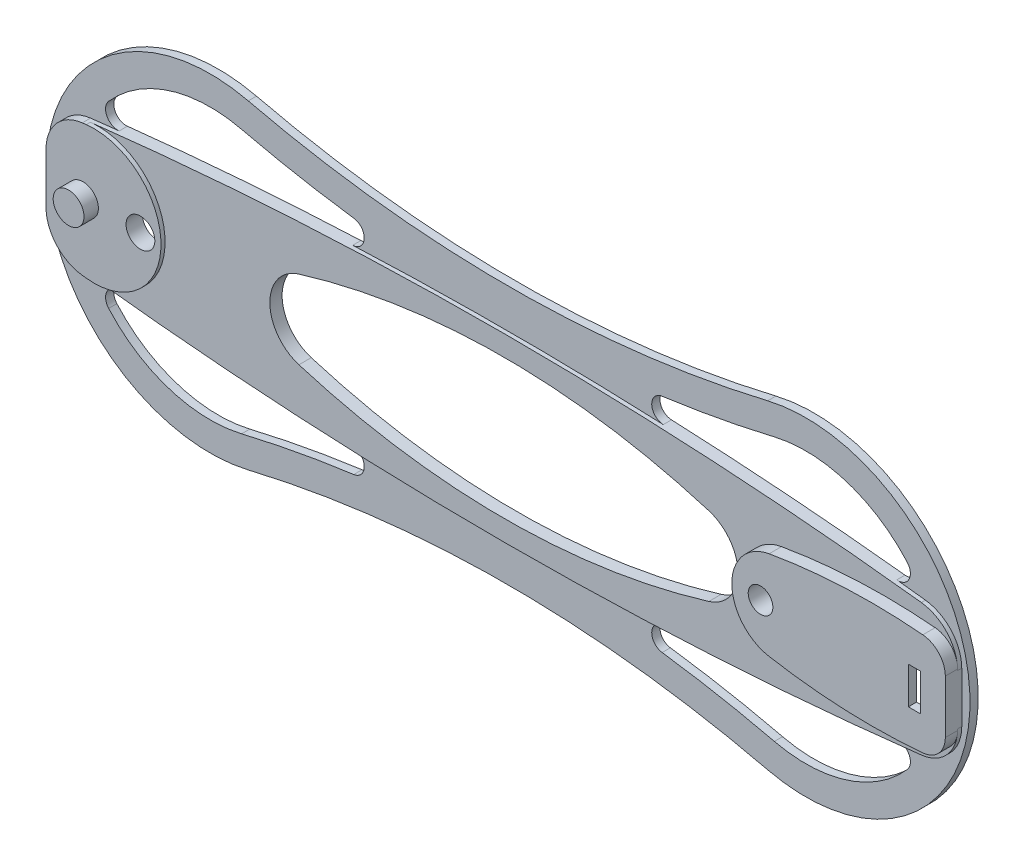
ISO-10303-21;
HEADER;
FILE_DESCRIPTION(('STEP AP214'),'2;1');
FILE_NAME('part.step','',(''),(''),'','','');
FILE_SCHEMA(('AUTOMOTIVE_DESIGN { 1 0 10303 214 1 1 1 1 }'));
ENDSEC;
DATA;
#1=APPLICATION_CONTEXT('core data for automotive mechanical design processes');
#2=APPLICATION_PROTOCOL_DEFINITION('international standard','automotive_design',2000,#1);
#3=PRODUCT_CONTEXT('',#1,'mechanical');
#4=PRODUCT('Part','Part','',(#3));
#5=PRODUCT_RELATED_PRODUCT_CATEGORY('part','',(#4));
#6=PRODUCT_DEFINITION_FORMATION('','',#4);
#7=PRODUCT_DEFINITION_CONTEXT('part definition',#1,'design');
#8=PRODUCT_DEFINITION('design','',#6,#7);
#9=PRODUCT_DEFINITION_SHAPE('','',#8);
#10=(LENGTH_UNIT() NAMED_UNIT(*) SI_UNIT(.MILLI.,.METRE.));
#11=(NAMED_UNIT(*) PLANE_ANGLE_UNIT() SI_UNIT($,.RADIAN.));
#12=(NAMED_UNIT(*) SI_UNIT($,.STERADIAN.) SOLID_ANGLE_UNIT());
#13=UNCERTAINTY_MEASURE_WITH_UNIT(LENGTH_MEASURE(1.E-05),#10,'distance_accuracy_value','');
#14=(GEOMETRIC_REPRESENTATION_CONTEXT(3) GLOBAL_UNCERTAINTY_ASSIGNED_CONTEXT((#13)) GLOBAL_UNIT_ASSIGNED_CONTEXT((#10,
#11,#12)) REPRESENTATION_CONTEXT('',''));
#15=CARTESIAN_POINT('',(0.,0.,0.));
#16=DIRECTION('',(0.,0.,1.));
#17=DIRECTION('',(1.,0.,0.));
#18=AXIS2_PLACEMENT_3D('',#15,#16,#17);
#19=CARTESIAN_POINT('',(69.5,0.,4.));
#20=DIRECTION('',(0.,0.,-1.));
#21=DIRECTION('',(-1.,0.,0.));
#22=AXIS2_PLACEMENT_3D('',#19,#20,#21);
#23=PLANE('',#22);
#24=DIRECTION('',(0.,1.,0.));
#25=VECTOR('',#24,1.);
#26=CARTESIAN_POINT('',(80.,10.4929451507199,4.));
#27=LINE('',#26,#25);
#28=CARTESIAN_POINT('',(80.,10.4497265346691,4.));
#29=VERTEX_POINT('',#28);
#30=CARTESIAN_POINT('',(80.,-10.4497265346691,4.));
#31=VERTEX_POINT('',#30);
#32=EDGE_CURVE('E595',#29,#31,#27,.F.);
#33=ORIENTED_EDGE('',*,*,#32,.T.);
#34=CARTESIAN_POINT('',(92.5,131.25,4.));
#35=DIRECTION('',(0.,0.,-1.));
#36=DIRECTION('',(-1.,0.,0.));
#37=AXIS2_PLACEMENT_3D('',#34,#35,#36);
#38=CIRCLE('',#37,142.25);
#39=CARTESIAN_POINT('',(67.9465290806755,-8.86491557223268,4.));
#40=VERTEX_POINT('',#39);
#41=EDGE_CURVE('E689',#31,#40,#38,.T.);
#42=ORIENTED_EDGE('',*,*,#41,.T.);
#43=CARTESIAN_POINT('',(69.5,0.,4.));
#44=DIRECTION('',(0.,0.,-1.));
#45=DIRECTION('',(-1.,0.,0.));
#46=AXIS2_PLACEMENT_3D('',#43,#44,#45);
#47=CIRCLE('',#46,9.);
#48=CARTESIAN_POINT('',(63.5,-6.70820393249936,4.));
#49=VERTEX_POINT('',#48);
#50=EDGE_CURVE('E672',#40,#49,#47,.T.);
#51=ORIENTED_EDGE('',*,*,#50,.T.);
#52=CARTESIAN_POINT('',(65.5,0.,4.));
#53=DIRECTION('',(0.,0.,-1.));
#54=DIRECTION('',(-1.,0.,0.));
#55=AXIS2_PLACEMENT_3D('',#52,#53,#54);
#56=CIRCLE('',#55,7.);
#57=CARTESIAN_POINT('',(63.5,6.70820393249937,4.));
#58=VERTEX_POINT('',#57);
#59=EDGE_CURVE('E657',#58,#49,#56,.T.);
#60=ORIENTED_EDGE('',*,*,#59,.F.);
#61=CARTESIAN_POINT('',(67.9465290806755,8.86491557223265,4.));
#62=VERTEX_POINT('',#61);
#63=EDGE_CURVE('E676',#58,#62,#47,.T.);
#64=ORIENTED_EDGE('',*,*,#63,.T.);
#65=CARTESIAN_POINT('',(92.5,-131.25,4.));
#66=DIRECTION('',(0.,0.,-1.));
#67=DIRECTION('',(-1.,0.,0.));
#68=AXIS2_PLACEMENT_3D('',#65,#66,#67);
#69=CIRCLE('',#68,142.25);
#70=EDGE_CURVE('E677',#62,#29,#69,.T.);
#71=ORIENTED_EDGE('',*,*,#70,.T.);
#72=EDGE_LOOP('',(#33,#42,#51,#60,#64,#71));
#73=FACE_BOUND('',#72,.T.);
#74=ADVANCED_FACE('F33',(#73),#23,.T.);
#75=CARTESIAN_POINT('',(92.5,131.25,4.));
#76=DIRECTION('',(0.,0.,-1.));
#77=DIRECTION('',(-1.,0.,0.));
#78=AXIS2_PLACEMENT_3D('',#75,#76,#77);
#79=CYLINDRICAL_SURFACE('',#78,142.25);
#80=CARTESIAN_POINT('',(92.5,131.25,0.));
#81=DIRECTION('',(0.,0.,-1.));
#82=DIRECTION('',(-1.,0.,0.));
#83=AXIS2_PLACEMENT_3D('',#80,#81,#82);
#84=CIRCLE('',#83,142.25);
#85=CARTESIAN_POINT('',(93.5000000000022,-10.996485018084,0.));
#86=VERTEX_POINT('',#85);
#87=CARTESIAN_POINT('',(80.4999999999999,-10.4929451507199,0.));
#88=VERTEX_POINT('',#87);
#89=EDGE_CURVE('E707',#86,#88,#84,.T.);
#90=ORIENTED_EDGE('',*,*,#89,.T.);
#91=DIRECTION('',(0.,0.,-1.));
#92=VECTOR('',#91,1.);
#93=CARTESIAN_POINT('',(80.4999999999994,-10.4929451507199,4.));
#94=LINE('',#93,#92);
#95=CARTESIAN_POINT('',(80.4999999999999,-10.4929451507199,4.));
#96=VERTEX_POINT('',#95);
#97=EDGE_CURVE('E835',#88,#96,#94,.F.);
#98=ORIENTED_EDGE('',*,*,#97,.T.);
#99=CARTESIAN_POINT('',(93.5000000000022,-10.996485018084,4.));
#100=VERTEX_POINT('',#99);
#101=EDGE_CURVE('E592',#100,#96,#38,.T.);
#102=ORIENTED_EDGE('',*,*,#101,.F.);
#103=DIRECTION('',(0.,0.,-1.));
#104=VECTOR('',#103,1.);
#105=CARTESIAN_POINT('',(93.5000000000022,-10.996485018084,4.));
#106=LINE('',#105,#104);
#107=EDGE_CURVE('E509',#100,#86,#106,.T.);
#108=ORIENTED_EDGE('',*,*,#107,.T.);
#109=EDGE_LOOP('',(#90,#98,#102,#108));
#110=FACE_BOUND('',#109,.T.);
#111=ADVANCED_FACE('F558',(#110),#79,.F.);
#112=CARTESIAN_POINT('',(92.5,-131.25,4.));
#113=DIRECTION('',(0.,0.,-1.));
#114=DIRECTION('',(-1.,0.,0.));
#115=AXIS2_PLACEMENT_3D('',#112,#113,#114);
#116=CYLINDRICAL_SURFACE('',#115,142.25);
#117=CARTESIAN_POINT('',(92.5,-131.25,0.));
#118=DIRECTION('',(0.,0.,-1.));
#119=DIRECTION('',(-1.,0.,0.));
#120=AXIS2_PLACEMENT_3D('',#117,#118,#119);
#121=CIRCLE('',#120,142.25);
#122=CARTESIAN_POINT('',(67.9465290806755,8.86491557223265,0.));
#123=VERTEX_POINT('',#122);
#124=CARTESIAN_POINT('',(80.4999999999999,10.4929451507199,0.));
#125=VERTEX_POINT('',#124);
#126=EDGE_CURVE('E465',#123,#125,#121,.T.);
#127=ORIENTED_EDGE('',*,*,#126,.T.);
#128=CARTESIAN_POINT('',(80.5,10.4929451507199,0.));
#129=CARTESIAN_POINT('',(80.4717923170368,10.4905574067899,-2.35191143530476E-05));
#130=CARTESIAN_POINT('',(80.4435920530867,10.4881611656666,0.00238562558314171));
#131=CARTESIAN_POINT('',(80.3880084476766,10.4834220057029,0.0118955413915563));
#132=CARTESIAN_POINT('',(80.3606245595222,10.4810790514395,0.0189930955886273));
#133=CARTESIAN_POINT('',(80.3074214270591,10.4765121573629,0.0377113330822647));
#134=CARTESIAN_POINT('',(80.2816029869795,10.4742882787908,0.0493343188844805));
#135=CARTESIAN_POINT('',(80.2322862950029,10.4700279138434,0.0767684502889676));
#136=CARTESIAN_POINT('',(80.2087875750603,10.4679913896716,0.0925787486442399));
#137=CARTESIAN_POINT('',(80.1648121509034,10.4641705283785,0.127919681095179));
#138=CARTESIAN_POINT('',(80.1443309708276,10.4623858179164,0.147444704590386));
#139=CARTESIAN_POINT('',(80.1069351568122,10.4591203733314,0.189684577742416));
#140=CARTESIAN_POINT('',(80.0900211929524,10.4576396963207,0.212400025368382));
#141=CARTESIAN_POINT('',(80.0603059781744,10.4550342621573,0.260289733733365));
#142=CARTESIAN_POINT('',(80.047491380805,10.4539083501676,0.285455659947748));
#143=CARTESIAN_POINT('',(80.0262768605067,10.4520424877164,0.337589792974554));
#144=CARTESIAN_POINT('',(80.0178741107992,10.4513022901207,0.364556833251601));
#145=CARTESIAN_POINT('',(80.0078769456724,10.4504212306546,0.409749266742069));
#146=CARTESIAN_POINT('',(80.004924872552,10.4501609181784,0.427683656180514));
#147=CARTESIAN_POINT('',(80.0009867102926,10.4498135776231,0.46374278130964));
#148=CARTESIAN_POINT('',(79.9999978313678,10.4497263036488,0.48186721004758));
#149=CARTESIAN_POINT('',(80.,10.4497265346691,0.500000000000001));
#150=B_SPLINE_CURVE_WITH_KNOTS('',3,(#128,#129,#130,#131,#132,#133,#134,#135,#136,#137,#138,
#139,#140,#141,#142,#143,#144,#145,#146,#147,#148,#149),.UNSPECIFIED.,.F.,.F.,(4,2,2,2,2,2,2,2,
2,2,4),(0.,0.0848139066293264,0.169569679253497,0.254368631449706,0.339150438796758,
0.423805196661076,0.508475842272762,0.592867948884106,0.677205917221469,0.731638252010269,
0.785993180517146),.UNSPECIFIED.);
#151=CARTESIAN_POINT('',(80.,10.4497265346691,0.5));
#152=VERTEX_POINT('',#151);
#153=EDGE_CURVE('E469',#125,#152,#150,.T.);
#154=ORIENTED_EDGE('',*,*,#153,.T.);
#155=DIRECTION('',(0.,0.,-1.));
#156=VECTOR('',#155,1.);
#157=CARTESIAN_POINT('',(80.,10.4497265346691,4.));
#158=LINE('',#157,#156);
#159=EDGE_CURVE('E508',#152,#29,#158,.F.);
#160=ORIENTED_EDGE('',*,*,#159,.T.);
#161=ORIENTED_EDGE('',*,*,#70,.F.);
#162=DIRECTION('',(0.,0.,-1.));
#163=VECTOR('',#162,1.);
#164=CARTESIAN_POINT('',(67.9465290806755,8.86491557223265,4.));
#165=LINE('',#164,#163);
#166=EDGE_CURVE('E473',#62,#123,#165,.T.);
#167=ORIENTED_EDGE('',*,*,#166,.T.);
#168=EDGE_LOOP('',(#127,#154,#160,#161,#167));
#169=FACE_BOUND('',#168,.T.);
#170=ADVANCED_FACE('F467',(#169),#116,.F.);
#171=DIRECTION('',(0.,1.,0.));
#172=VECTOR('',#171,1.);
#173=CARTESIAN_POINT('',(101.5,0.,4.));
#174=LINE('',#173,#172);
#175=CARTESIAN_POINT('',(101.5,-4.5,4.));
#176=VERTEX_POINT('',#175);
#177=CARTESIAN_POINT('',(101.5,4.5,4.));
#178=VERTEX_POINT('',#177);
#179=EDGE_CURVE('E654',#176,#178,#174,.T.);
#180=ORIENTED_EDGE('',*,*,#179,.F.);
#181=DIRECTION('',(-1.,0.,0.));
#182=VECTOR('',#181,1.);
#183=CARTESIAN_POINT('',(69.5,-4.50000000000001,4.));
#184=LINE('',#183,#182);
#185=CARTESIAN_POINT('',(104.5,-4.5,4.));
#186=VERTEX_POINT('',#185);
#187=EDGE_CURVE('E641',#186,#176,#184,.T.);
#188=ORIENTED_EDGE('',*,*,#187,.F.);
#189=DIRECTION('',(0.,-1.,0.));
#190=VECTOR('',#189,1.);
#191=CARTESIAN_POINT('',(104.5,0.,4.));
#192=LINE('',#191,#190);
#193=CARTESIAN_POINT('',(104.5,4.5,4.));
#194=VERTEX_POINT('',#193);
#195=EDGE_CURVE('E649',#194,#186,#192,.T.);
#196=ORIENTED_EDGE('',*,*,#195,.F.);
#197=DIRECTION('',(1.,0.,0.));
#198=VECTOR('',#197,1.);
#199=CARTESIAN_POINT('',(69.5,4.50000000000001,4.));
#200=LINE('',#199,#198);
#201=EDGE_CURVE('E652',#178,#194,#200,.T.);
#202=ORIENTED_EDGE('',*,*,#201,.F.);
#203=EDGE_LOOP('',(#180,#188,#196,#202));
#204=FACE_BOUND('',#203,.T.);
#205=CARTESIAN_POINT('',(104.847197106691,-10.4631229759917,4.));
#206=VERTEX_POINT('',#205);
#207=CARTESIAN_POINT('',(94.,-10.9920911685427,4.));
#208=VERTEX_POINT('',#207);
#209=EDGE_CURVE('E690',#206,#208,#38,.T.);
#210=ORIENTED_EDGE('',*,*,#209,.T.);
#211=DIRECTION('',(0.,1.,0.));
#212=VECTOR('',#211,1.);
#213=CARTESIAN_POINT('',(94.,10.996485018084,4.));
#214=LINE('',#213,#212);
#215=CARTESIAN_POINT('',(94.,10.9920911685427,4.));
#216=VERTEX_POINT('',#215);
#217=EDGE_CURVE('E610',#216,#208,#214,.F.);
#218=ORIENTED_EDGE('',*,*,#217,.F.);
#219=CARTESIAN_POINT('',(104.847197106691,10.4631229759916,4.));
#220=VERTEX_POINT('',#219);
#221=EDGE_CURVE('E675',#216,#220,#69,.T.);
#222=ORIENTED_EDGE('',*,*,#221,.T.);
#223=CARTESIAN_POINT('',(104.5,6.4782196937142,4.));
#224=DIRECTION('',(0.,0.,-1.));
#225=DIRECTION('',(-1.,0.,0.));
#226=AXIS2_PLACEMENT_3D('',#223,#224,#225);
#227=CIRCLE('',#226,4.);
#228=CARTESIAN_POINT('',(108.5,6.47821969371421,4.));
#229=VERTEX_POINT('',#228);
#230=EDGE_CURVE('E680',#220,#229,#227,.T.);
#231=ORIENTED_EDGE('',*,*,#230,.T.);
#232=DIRECTION('',(0.,-1.,0.));
#233=VECTOR('',#232,1.);
#234=CARTESIAN_POINT('',(108.5,6.47821969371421,4.));
#235=LINE('',#234,#233);
#236=CARTESIAN_POINT('',(108.5,-6.4782196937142,4.));
#237=VERTEX_POINT('',#236);
#238=EDGE_CURVE('E683',#229,#237,#235,.T.);
#239=ORIENTED_EDGE('',*,*,#238,.T.);
#240=CARTESIAN_POINT('',(104.5,-6.4782196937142,4.));
#241=DIRECTION('',(0.,0.,-1.));
#242=DIRECTION('',(-1.,0.,0.));
#243=AXIS2_PLACEMENT_3D('',#240,#241,#242);
#244=CIRCLE('',#243,4.00000000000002);
#245=EDGE_CURVE('E686',#237,#206,#244,.T.);
#246=ORIENTED_EDGE('',*,*,#245,.T.);
#247=EDGE_LOOP('',(#210,#218,#222,#231,#239,#246));
#248=FACE_BOUND('',#247,.T.);
#249=ADVANCED_FACE('F561',(#204,#248),#23,.T.);
#250=DIRECTION('',(0.,0.,-1.));
#251=VECTOR('',#250,1.);
#252=CARTESIAN_POINT('',(94.,-10.9920911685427,4.));
#253=LINE('',#252,#251);
#254=CARTESIAN_POINT('',(94.,-10.9920911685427,0.5));
#255=VERTEX_POINT('',#254);
#256=EDGE_CURVE('E625',#208,#255,#253,.T.);
#257=ORIENTED_EDGE('',*,*,#256,.F.);
#258=ORIENTED_EDGE('',*,*,#209,.F.);
#259=DIRECTION('',(0.,0.,-1.));
#260=VECTOR('',#259,1.);
#261=CARTESIAN_POINT('',(104.847197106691,-10.4631229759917,4.));
#262=LINE('',#261,#260);
#263=CARTESIAN_POINT('',(104.847197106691,-10.4631229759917,0.));
#264=VERTEX_POINT('',#263);
#265=EDGE_CURVE('E712',#206,#264,#262,.T.);
#266=ORIENTED_EDGE('',*,*,#265,.T.);
#267=EDGE_CURVE('E705',#264,#86,#84,.T.);
#268=ORIENTED_EDGE('',*,*,#267,.T.);
#269=CARTESIAN_POINT('',(93.5,-10.996485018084,0.));
#270=CARTESIAN_POINT('',(93.5281300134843,-10.996287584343,-2.38862519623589E-05));
#271=CARTESIAN_POINT('',(93.5562528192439,-10.9960812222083,0.00237246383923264));
#272=CARTESIAN_POINT('',(93.6116812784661,-10.995658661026,0.011829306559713));
#273=CARTESIAN_POINT('',(93.6389875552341,-10.9954424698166,0.0188861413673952));
#274=CARTESIAN_POINT('',(93.6920395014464,-10.9950078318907,0.0374925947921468));
#275=CARTESIAN_POINT('',(93.7177844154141,-10.9947893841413,0.0490443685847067));
#276=CARTESIAN_POINT('',(93.7669653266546,-10.9943598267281,0.0763027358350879));
#277=CARTESIAN_POINT('',(93.7904017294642,-10.9941487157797,0.0920085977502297));
#278=CARTESIAN_POINT('',(93.8343050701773,-10.9937436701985,0.127131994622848));
#279=CARTESIAN_POINT('',(93.8547720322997,-10.9935497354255,0.146549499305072));
#280=CARTESIAN_POINT('',(93.8921596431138,-10.9931887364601,0.188549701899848));
#281=CARTESIAN_POINT('',(93.9090795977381,-10.993021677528,0.211133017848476));
#282=CARTESIAN_POINT('',(93.9388896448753,-10.992723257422,0.258821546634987));
#283=CARTESIAN_POINT('',(93.9517790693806,-10.9925919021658,0.28392717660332));
#284=CARTESIAN_POINT('',(93.9731533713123,-10.9923721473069,0.335941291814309));
#285=CARTESIAN_POINT('',(93.9816408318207,-10.9922837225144,0.362848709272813));
#286=CARTESIAN_POINT('',(93.9918602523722,-10.9921768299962,0.408267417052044));
#287=CARTESIAN_POINT('',(93.9949108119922,-10.9921447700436,0.426492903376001));
#288=CARTESIAN_POINT('',(93.9989804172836,-10.9921019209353,0.463143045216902));
#289=CARTESIAN_POINT('',(94.000002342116,-10.9920911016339,0.481567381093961));
#290=CARTESIAN_POINT('',(94.,-10.9920911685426,0.500000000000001));
#291=B_SPLINE_CURVE_WITH_KNOTS('',3,(#269,#270,#271,#272,#273,#274,#275,#276,#277,#278,#279,
#280,#281,#282,#283,#284,#285,#286,#287,#288,#289,#290),.UNSPECIFIED.,.F.,.F.,(4,2,2,2,2,2,2,2,
2,2,4),(0.,0.0842799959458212,0.168493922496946,0.25274827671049,0.336987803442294,
0.421226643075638,0.505481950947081,0.589751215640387,0.673970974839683,0.72930298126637,
0.784556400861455),.UNSPECIFIED.);
#292=EDGE_CURVE('E11',#86,#255,#291,.T.);
#293=ORIENTED_EDGE('',*,*,#292,.T.);
#294=EDGE_LOOP('',(#257,#258,#266,#268,#293));
#295=FACE_BOUND('',#294,.T.);
#296=ADVANCED_FACE('F567',(#295),#79,.F.);
#297=DIRECTION('',(0.,0.,-1.));
#298=VECTOR('',#297,1.);
#299=CARTESIAN_POINT('',(94.,10.9920911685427,4.));
#300=LINE('',#299,#298);
#301=CARTESIAN_POINT('',(94.,10.9920911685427,0.5));
#302=VERTEX_POINT('',#301);
#303=EDGE_CURVE('E829',#302,#216,#300,.F.);
#304=ORIENTED_EDGE('',*,*,#303,.F.);
#305=CARTESIAN_POINT('',(94.,10.9920911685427,0.5));
#306=CARTESIAN_POINT('',(94.0000238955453,10.9920906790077,0.471871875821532));
#307=CARTESIAN_POINT('',(93.997627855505,10.9921161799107,0.443750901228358));
#308=CARTESIAN_POINT('',(93.9881722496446,10.992215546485,0.388326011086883));
#309=CARTESIAN_POINT('',(93.9811163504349,10.99228937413,0.36102147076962));
#310=CARTESIAN_POINT('',(93.9625124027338,10.9924818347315,0.307972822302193));
#311=CARTESIAN_POINT('',(93.9509622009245,10.9926004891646,0.282229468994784));
#312=CARTESIAN_POINT('',(93.9237076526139,10.9928758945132,0.233051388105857));
#313=CARTESIAN_POINT('',(93.9080040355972,10.9930326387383,0.209616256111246));
#314=CARTESIAN_POINT('',(93.8728853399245,10.9933759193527,0.165714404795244));
#315=CARTESIAN_POINT('',(93.8534701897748,10.9935624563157,0.145247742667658));
#316=CARTESIAN_POINT('',(93.8114751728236,10.9939558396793,0.107860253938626));
#317=CARTESIAN_POINT('',(93.7888946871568,10.994162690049,0.0909401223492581));
#318=CARTESIAN_POINT('',(93.7412103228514,10.994586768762,0.061127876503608));
#319=CARTESIAN_POINT('',(93.7161058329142,10.9948039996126,0.0482367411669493));
#320=CARTESIAN_POINT('',(93.6640938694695,10.9952391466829,0.0268588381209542));
#321=CARTESIAN_POINT('',(93.6371874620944,10.9954570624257,0.0183694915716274));
#322=CARTESIAN_POINT('',(93.5917637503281,10.9958114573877,0.00814532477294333));
#323=CARTESIAN_POINT('',(93.5735321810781,10.9959502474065,0.00509267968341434));
#324=CARTESIAN_POINT('',(93.5368696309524,10.9962222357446,0.00102028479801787));
#325=CARTESIAN_POINT('',(93.5184389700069,10.9963554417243,-2.34558291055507E-06));
#326=CARTESIAN_POINT('',(93.5000000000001,10.9964850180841,0.));
#327=B_SPLINE_CURVE_WITH_KNOTS('',3,(#305,#306,#307,#308,#309,#310,#311,#312,#313,#314,#315,
#316,#317,#318,#319,#320,#321,#322,#323,#324,#325,#326),.UNSPECIFIED.,.F.,.F.,(4,2,2,2,2,2,2,2,
2,2,4),(0.,0.0842722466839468,0.168478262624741,0.252724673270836,0.336956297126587,
0.421189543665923,0.50543928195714,0.589709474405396,0.673930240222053,0.729282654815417,
0.784556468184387),.UNSPECIFIED.);
#328=CARTESIAN_POINT('',(93.5000000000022,10.996485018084,0.));
#329=VERTEX_POINT('',#328);
#330=EDGE_CURVE('E43',#302,#329,#327,.T.);
#331=ORIENTED_EDGE('',*,*,#330,.T.);
#332=CARTESIAN_POINT('',(104.847197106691,10.4631229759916,0.));
#333=VERTEX_POINT('',#332);
#334=EDGE_CURVE('E480',#329,#333,#121,.T.);
#335=ORIENTED_EDGE('',*,*,#334,.T.);
#336=DIRECTION('',(0.,0.,-1.));
#337=VECTOR('',#336,1.);
#338=CARTESIAN_POINT('',(104.847197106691,10.4631229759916,4.));
#339=LINE('',#338,#337);
#340=EDGE_CURVE('E718',#220,#333,#339,.T.);
#341=ORIENTED_EDGE('',*,*,#340,.F.);
#342=ORIENTED_EDGE('',*,*,#221,.F.);
#343=EDGE_LOOP('',(#304,#331,#335,#341,#342));
#344=FACE_BOUND('',#343,.T.);
#345=ADVANCED_FACE('F873',(#344),#116,.F.);
#346=CARTESIAN_POINT('',(69.5,0.,4.));
#347=DIRECTION('',(0.,0.,-1.));
#348=DIRECTION('',(-1.,0.,0.));
#349=AXIS2_PLACEMENT_3D('',#346,#347,#348);
#350=CYLINDRICAL_SURFACE('',#349,9.);
#351=DIRECTION('',(0.,0.,1.));
#352=VECTOR('',#351,1.);
#353=CARTESIAN_POINT('',(63.5,6.70820393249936,-18.4390889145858));
#354=LINE('',#353,#352);
#355=CARTESIAN_POINT('',(63.5,6.70820393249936,0.));
#356=VERTEX_POINT('',#355);
#357=EDGE_CURVE('E660',#356,#58,#354,.T.);
#358=ORIENTED_EDGE('',*,*,#357,.F.);
#359=CARTESIAN_POINT('',(69.5,0.,0.));
#360=DIRECTION('',(0.,0.,-1.));
#361=DIRECTION('',(-1.,0.,0.));
#362=AXIS2_PLACEMENT_3D('',#359,#360,#361);
#363=CIRCLE('',#362,9.);
#364=EDGE_CURVE('E671',#356,#123,#363,.T.);
#365=ORIENTED_EDGE('',*,*,#364,.T.);
#366=ORIENTED_EDGE('',*,*,#166,.F.);
#367=ORIENTED_EDGE('',*,*,#63,.F.);
#368=EDGE_LOOP('',(#358,#365,#366,#367));
#369=FACE_BOUND('',#368,.T.);
#370=ADVANCED_FACE('F583',(#369),#350,.F.);
#371=DIRECTION('',(0.,0.,1.));
#372=VECTOR('',#371,1.);
#373=CARTESIAN_POINT('',(63.5,-6.70820393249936,-18.4390889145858));
#374=LINE('',#373,#372);
#375=CARTESIAN_POINT('',(63.5,-6.70820393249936,0.));
#376=VERTEX_POINT('',#375);
#377=EDGE_CURVE('E656',#376,#49,#374,.T.);
#378=ORIENTED_EDGE('',*,*,#377,.T.);
#379=ORIENTED_EDGE('',*,*,#50,.F.);
#380=DIRECTION('',(0.,0.,-1.));
#381=VECTOR('',#380,1.);
#382=CARTESIAN_POINT('',(67.9465290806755,-8.86491557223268,4.));
#383=LINE('',#382,#381);
#384=CARTESIAN_POINT('',(67.9465290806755,-8.86491557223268,0.));
#385=VERTEX_POINT('',#384);
#386=EDGE_CURVE('E708',#40,#385,#383,.T.);
#387=ORIENTED_EDGE('',*,*,#386,.T.);
#388=EDGE_CURVE('E693',#385,#376,#363,.T.);
#389=ORIENTED_EDGE('',*,*,#388,.T.);
#390=EDGE_LOOP('',(#378,#379,#387,#389));
#391=FACE_BOUND('',#390,.T.);
#392=ADVANCED_FACE('F574',(#391),#350,.F.);
#393=DIRECTION('',(1.,0.,0.));
#394=VECTOR('',#393,1.);
#395=CARTESIAN_POINT('',(80.,-10.4929451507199,4.));
#396=LINE('',#395,#394);
#397=CARTESIAN_POINT('',(81.,-10.4929451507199,4.));
#398=VERTEX_POINT('',#397);
#399=EDGE_CURVE('E589',#96,#398,#396,.T.);
#400=ORIENTED_EDGE('',*,*,#399,.T.);
#401=DIRECTION('',(0.,1.,0.));
#402=VECTOR('',#401,1.);
#403=CARTESIAN_POINT('',(81.,10.4929451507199,4.));
#404=LINE('',#403,#402);
#405=CARTESIAN_POINT('',(81.,10.4929451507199,4.));
#406=VERTEX_POINT('',#405);
#407=EDGE_CURVE('E516',#406,#398,#404,.F.);
#408=ORIENTED_EDGE('',*,*,#407,.F.);
#409=DIRECTION('',(-1.,0.,0.));
#410=VECTOR('',#409,1.);
#411=CARTESIAN_POINT('',(81.,10.4929451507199,4.));
#412=LINE('',#411,#410);
#413=CARTESIAN_POINT('',(80.4999999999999,10.4929451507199,4.));
#414=VERTEX_POINT('',#413);
#415=EDGE_CURVE('E603',#406,#414,#412,.T.);
#416=ORIENTED_EDGE('',*,*,#415,.T.);
#417=CARTESIAN_POINT('',(93.5000000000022,10.996485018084,4.));
#418=VERTEX_POINT('',#417);
#419=EDGE_CURVE('E507',#414,#418,#69,.T.);
#420=ORIENTED_EDGE('',*,*,#419,.T.);
#421=DIRECTION('',(-1.,0.,0.));
#422=VECTOR('',#421,1.);
#423=CARTESIAN_POINT('',(94.,10.996485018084,4.));
#424=LINE('',#423,#422);
#425=CARTESIAN_POINT('',(93.,10.996485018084,4.));
#426=VERTEX_POINT('',#425);
#427=EDGE_CURVE('E618',#418,#426,#424,.T.);
#428=ORIENTED_EDGE('',*,*,#427,.T.);
#429=DIRECTION('',(0.,1.,0.));
#430=VECTOR('',#429,1.);
#431=CARTESIAN_POINT('',(93.,10.996485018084,4.));
#432=LINE('',#431,#430);
#433=CARTESIAN_POINT('',(93.,-10.996485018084,4.));
#434=VERTEX_POINT('',#433);
#435=EDGE_CURVE('E615',#426,#434,#432,.F.);
#436=ORIENTED_EDGE('',*,*,#435,.T.);
#437=DIRECTION('',(1.,0.,0.));
#438=VECTOR('',#437,1.);
#439=CARTESIAN_POINT('',(93.,-10.996485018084,4.));
#440=LINE('',#439,#438);
#441=EDGE_CURVE('E613',#434,#100,#440,.T.);
#442=ORIENTED_EDGE('',*,*,#441,.T.);
#443=ORIENTED_EDGE('',*,*,#101,.T.);
#444=EDGE_LOOP('',(#400,#408,#416,#420,#428,#436,#442,#443));
#445=FACE_BOUND('',#444,.T.);
#446=ADVANCED_FACE('F562',(#445),#23,.T.);
#447=CARTESIAN_POINT('',(-100.5,6.14637004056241,3.));
#448=DIRECTION('',(0.,0.,-1.));
#449=DIRECTION('',(-1.,0.,0.));
#450=AXIS2_PLACEMENT_3D('',#447,#448,#449);
#451=PLANE('',#450);
#452=CARTESIAN_POINT('',(0.,-154.285714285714,3.));
#453=DIRECTION('',(0.,0.,1.));
#454=DIRECTION('',(1.,0.,0.));
#455=AXIS2_PLACEMENT_3D('',#452,#453,#454);
#456=CIRCLE('',#455,171.285714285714);
#457=CARTESIAN_POINT('',(49.9140832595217,9.56598759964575,3.));
#458=VERTEX_POINT('',#457);
#459=CARTESIAN_POINT('',(-49.9140832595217,9.56598759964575,3.));
#460=VERTEX_POINT('',#459);
#461=EDGE_CURVE('E1844',#458,#460,#456,.T.);
#462=ORIENTED_EDGE('',*,*,#461,.F.);
#463=CARTESIAN_POINT('',(47.,0.,3.));
#464=DIRECTION('',(0.,0.,1.));
#465=DIRECTION('',(1.,0.,0.));
#466=AXIS2_PLACEMENT_3D('',#463,#464,#465);
#467=CIRCLE('',#466,10.);
#468=CARTESIAN_POINT('',(49.9140832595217,-9.56598759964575,3.));
#469=VERTEX_POINT('',#468);
#470=EDGE_CURVE('E1852',#469,#458,#467,.T.);
#471=ORIENTED_EDGE('',*,*,#470,.F.);
#472=CARTESIAN_POINT('',(0.,154.285714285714,3.));
#473=DIRECTION('',(0.,0.,1.));
#474=DIRECTION('',(1.,0.,0.));
#475=AXIS2_PLACEMENT_3D('',#472,#473,#474);
#476=CIRCLE('',#475,171.285714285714);
#477=CARTESIAN_POINT('',(-49.9140832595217,-9.56598759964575,3.));
#478=VERTEX_POINT('',#477);
#479=EDGE_CURVE('E1849',#478,#469,#476,.T.);
#480=ORIENTED_EDGE('',*,*,#479,.F.);
#481=CARTESIAN_POINT('',(-47.,0.,3.));
#482=DIRECTION('',(0.,0.,1.));
#483=DIRECTION('',(1.,0.,0.));
#484=AXIS2_PLACEMENT_3D('',#481,#482,#483);
#485=CIRCLE('',#484,10.);
#486=EDGE_CURVE('E1846',#460,#478,#485,.T.);
#487=ORIENTED_EDGE('',*,*,#486,.F.);
#488=EDGE_LOOP('',(#462,#471,#480,#487));
#489=FACE_BOUND('',#488,.T.);
#490=CARTESIAN_POINT('',(104.5,-6.4782196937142,3.));
#491=DIRECTION('',(0.,0.,1.));
#492=DIRECTION('',(1.,0.,0.));
#493=AXIS2_PLACEMENT_3D('',#490,#491,#492);
#494=CIRCLE('',#493,6.00000000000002);
#495=CARTESIAN_POINT('',(105.020795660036,-12.4555746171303,3.));
#496=VERTEX_POINT('',#495);
#497=CARTESIAN_POINT('',(110.392377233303,-7.60954216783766,3.));
#498=VERTEX_POINT('',#497);
#499=EDGE_CURVE('E743',#496,#498,#494,.T.);
#500=ORIENTED_EDGE('',*,*,#499,.F.);
#501=CARTESIAN_POINT('',(92.5,131.25,3.));
#502=DIRECTION('',(0.,0.,1.));
#503=DIRECTION('',(-1.,0.,0.));
#504=AXIS2_PLACEMENT_3D('',#501,#502,#503);
#505=CIRCLE('',#504,144.25);
#506=CARTESIAN_POINT('',(67.6013133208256,-10.8348968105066,3.));
#507=VERTEX_POINT('',#506);
#508=EDGE_CURVE('E739',#507,#496,#505,.T.);
#509=ORIENTED_EDGE('',*,*,#508,.F.);
#510=CARTESIAN_POINT('',(69.5,0.,3.));
#511=DIRECTION('',(0.,0.,1.));
#512=DIRECTION('',(1.,0.,0.));
#513=AXIS2_PLACEMENT_3D('',#510,#511,#512);
#514=CIRCLE('',#513,11.);
#515=CARTESIAN_POINT('',(67.6013133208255,10.8348968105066,3.));
#516=VERTEX_POINT('',#515);
#517=EDGE_CURVE('E711',#516,#507,#514,.T.);
#518=ORIENTED_EDGE('',*,*,#517,.F.);
#519=CARTESIAN_POINT('',(92.5,-131.25,3.));
#520=DIRECTION('',(0.,0.,1.));
#521=DIRECTION('',(1.,0.,0.));
#522=AXIS2_PLACEMENT_3D('',#519,#520,#521);
#523=CIRCLE('',#522,144.25);
#524=CARTESIAN_POINT('',(105.020795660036,12.4555746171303,3.));
#525=VERTEX_POINT('',#524);
#526=EDGE_CURVE('E726',#525,#516,#523,.T.);
#527=ORIENTED_EDGE('',*,*,#526,.F.);
#528=CARTESIAN_POINT('',(104.5,6.4782196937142,3.));
#529=DIRECTION('',(0.,0.,1.));
#530=DIRECTION('',(-1.,0.,0.));
#531=AXIS2_PLACEMENT_3D('',#528,#529,#530);
#532=CIRCLE('',#531,6.00000000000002);
#533=CARTESIAN_POINT('',(110.392377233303,7.60954216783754,3.));
#534=VERTEX_POINT('',#533);
#535=EDGE_CURVE('E750',#534,#525,#532,.T.);
#536=ORIENTED_EDGE('',*,*,#535,.F.);
#537=CARTESIAN_POINT('',(100.5,6.14637004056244,3.));
#538=DIRECTION('',(0.,0.,1.));
#539=DIRECTION('',(-1.,0.,0.));
#540=AXIS2_PLACEMENT_3D('',#537,#538,#539);
#541=CIRCLE('',#540,10.);
#542=CARTESIAN_POINT('',(101.660962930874,16.0787496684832,3.));
#543=VERTEX_POINT('',#542);
#544=EDGE_CURVE('E1658',#534,#543,#541,.T.);
#545=ORIENTED_EDGE('',*,*,#544,.T.);
#546=CARTESIAN_POINT('',(1.2490009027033E-13,-853.660714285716,3.));
#547=DIRECTION('',(0.,0.,1.));
#548=DIRECTION('',(1.,0.,0.));
#549=AXIS2_PLACEMENT_3D('',#546,#547,#548);
#550=CIRCLE('',#549,875.660714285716);
#551=CARTESIAN_POINT('',(-100.675647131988,16.1933542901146,3.));
#552=VERTEX_POINT('',#551);
#553=EDGE_CURVE('E814',#543,#552,#550,.T.);
#554=ORIENTED_EDGE('',*,*,#553,.T.);
#555=CARTESIAN_POINT('',(-98.8014518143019,0.,3.));
#556=DIRECTION('',(0.,0.,1.));
#557=DIRECTION('',(1.,0.,0.));
#558=AXIS2_PLACEMENT_3D('',#555,#556,#557);
#559=CIRCLE('',#558,16.3014518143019);
#560=CARTESIAN_POINT('',(-100.675647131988,-16.1933542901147,3.));
#561=VERTEX_POINT('',#560);
#562=EDGE_CURVE('E786',#561,#552,#559,.T.);
#563=ORIENTED_EDGE('',*,*,#562,.F.);
#564=CARTESIAN_POINT('',(1.2490009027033E-13,853.660714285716,3.));
#565=DIRECTION('',(0.,0.,1.));
#566=DIRECTION('',(1.,0.,0.));
#567=AXIS2_PLACEMENT_3D('',#564,#565,#566);
#568=CIRCLE('',#567,875.660714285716);
#569=CARTESIAN_POINT('',(101.660962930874,-16.0787496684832,3.));
#570=VERTEX_POINT('',#569);
#571=EDGE_CURVE('E1647',#561,#570,#568,.T.);
#572=ORIENTED_EDGE('',*,*,#571,.T.);
#573=CARTESIAN_POINT('',(100.5,-6.14637004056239,3.));
#574=DIRECTION('',(0.,0.,1.));
#575=DIRECTION('',(-1.,0.,0.));
#576=AXIS2_PLACEMENT_3D('',#573,#574,#575);
#577=CIRCLE('',#576,10.);
#578=EDGE_CURVE('E1649',#570,#498,#577,.T.);
#579=ORIENTED_EDGE('',*,*,#578,.T.);
#580=EDGE_LOOP('',(#500,#509,#518,#527,#536,#545,#554,#563,#572,#579));
#581=FACE_BOUND('',#580,.T.);
#582=ADVANCED_FACE('F573',(#489,#581),#451,.F.);
#583=CARTESIAN_POINT('',(-100.5,6.14637004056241,4.));
#584=DIRECTION('',(0.,0.,1.));
#585=DIRECTION('',(1.,0.,0.));
#586=AXIS2_PLACEMENT_3D('',#583,#584,#585);
#587=PLANE('',#586);
#588=CARTESIAN_POINT('',(-87.5,0.,4.));
#589=DIRECTION('',(0.,0.,1.));
#590=DIRECTION('',(1.,0.,0.));
#591=AXIS2_PLACEMENT_3D('',#588,#589,#590);
#592=CIRCLE('',#591,3.50000000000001);
#593=CARTESIAN_POINT('',(-84.,0.,4.));
#594=VERTEX_POINT('',#593);
#595=EDGE_CURVE('E776',#594,#594,#592,.T.);
#596=ORIENTED_EDGE('',*,*,#595,.F.);
#597=EDGE_LOOP('',(#596));
#598=FACE_BOUND('',#597,.T.);
#599=CARTESIAN_POINT('',(-100.5,6.14637004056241,4.));
#600=DIRECTION('',(0.,0.,1.));
#601=DIRECTION('',(1.,0.,0.));
#602=AXIS2_PLACEMENT_3D('',#599,#600,#601);
#603=CIRCLE('',#602,10.);
#604=CARTESIAN_POINT('',(-101.660962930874,16.0787496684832,4.));
#605=VERTEX_POINT('',#604);
#606=CARTESIAN_POINT('',(-110.5,6.14637004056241,4.));
#607=VERTEX_POINT('',#606);
#608=EDGE_CURVE('E789',#605,#607,#603,.T.);
#609=ORIENTED_EDGE('',*,*,#608,.T.);
#610=DIRECTION('',(0.,-1.,0.));
#611=VECTOR('',#610,1.);
#612=CARTESIAN_POINT('',(-110.5,6.14637004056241,4.));
#613=LINE('',#612,#611);
#614=CARTESIAN_POINT('',(-110.5,-6.14637004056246,4.));
#615=VERTEX_POINT('',#614);
#616=EDGE_CURVE('E792',#607,#615,#613,.T.);
#617=ORIENTED_EDGE('',*,*,#616,.T.);
#618=CARTESIAN_POINT('',(-100.5,-6.14637004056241,4.));
#619=DIRECTION('',(0.,0.,1.));
#620=DIRECTION('',(1.,0.,0.));
#621=AXIS2_PLACEMENT_3D('',#618,#619,#620);
#622=CIRCLE('',#621,10.);
#623=CARTESIAN_POINT('',(-101.660962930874,-16.0787496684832,4.));
#624=VERTEX_POINT('',#623);
#625=EDGE_CURVE('E795',#615,#624,#622,.T.);
#626=ORIENTED_EDGE('',*,*,#625,.T.);
#627=CARTESIAN_POINT('',(1.2490009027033E-13,853.660714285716,4.));
#628=DIRECTION('',(0.,0.,1.));
#629=DIRECTION('',(1.,0.,0.));
#630=AXIS2_PLACEMENT_3D('',#627,#628,#629);
#631=CIRCLE('',#630,875.660714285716);
#632=CARTESIAN_POINT('',(-100.675647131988,-16.1933542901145,4.));
#633=VERTEX_POINT('',#632);
#634=EDGE_CURVE('E798',#624,#633,#631,.T.);
#635=ORIENTED_EDGE('',*,*,#634,.T.);
#636=CARTESIAN_POINT('',(-98.8014518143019,0.,4.));
#637=DIRECTION('',(0.,0.,1.));
#638=DIRECTION('',(1.,0.,0.));
#639=AXIS2_PLACEMENT_3D('',#636,#637,#638);
#640=CIRCLE('',#639,16.3014518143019);
#641=CARTESIAN_POINT('',(-100.675647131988,16.1933542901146,4.));
#642=VERTEX_POINT('',#641);
#643=EDGE_CURVE('E800',#633,#642,#640,.T.);
#644=ORIENTED_EDGE('',*,*,#643,.T.);
#645=CARTESIAN_POINT('',(1.2490009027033E-13,-853.660714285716,4.));
#646=DIRECTION('',(0.,0.,1.));
#647=DIRECTION('',(1.,0.,0.));
#648=AXIS2_PLACEMENT_3D('',#645,#646,#647);
#649=CIRCLE('',#648,875.660714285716);
#650=EDGE_CURVE('E802',#642,#605,#649,.T.);
#651=ORIENTED_EDGE('',*,*,#650,.T.);
#652=EDGE_LOOP('',(#609,#617,#626,#635,#644,#651));
#653=FACE_BOUND('',#652,.T.);
#654=CARTESIAN_POINT('',(-101.5,0.,4.));
#655=DIRECTION('',(0.,0.,1.));
#656=DIRECTION('',(1.,0.,0.));
#657=AXIS2_PLACEMENT_3D('',#654,#655,#656);
#658=CIRCLE('',#657,3.75000000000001);
#659=CARTESIAN_POINT('',(-97.75,0.,4.));
#660=VERTEX_POINT('',#659);
#661=EDGE_CURVE('E780',#660,#660,#658,.T.);
#662=ORIENTED_EDGE('',*,*,#661,.F.);
#663=EDGE_LOOP('',(#662));
#664=FACE_BOUND('',#663,.T.);
#665=ADVANCED_FACE('F580',(#598,#653,#664),#587,.T.);
#666=CARTESIAN_POINT('',(1.2490009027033E-13,853.660714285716,3.));
#667=DIRECTION('',(0.,0.,-1.));
#668=DIRECTION('',(-1.,0.,0.));
#669=AXIS2_PLACEMENT_3D('',#666,#667,#668);
#670=CYLINDRICAL_SURFACE('',#669,875.660714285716);
#671=DIRECTION('',(0.,0.,-1.));
#672=VECTOR('',#671,1.);
#673=CARTESIAN_POINT('',(94.669699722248,-16.8674785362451,40.2567519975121));
#674=LINE('',#673,#672);
#675=CARTESIAN_POINT('',(94.669699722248,-16.8674785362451,2.00000000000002));
#676=VERTEX_POINT('',#675);
#677=CARTESIAN_POINT('',(94.669699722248,-16.8674785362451,0.));
#678=VERTEX_POINT('',#677);
#679=EDGE_CURVE('E824',#676,#678,#674,.T.);
#680=ORIENTED_EDGE('',*,*,#679,.F.);
#681=CARTESIAN_POINT('',(1.2490009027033E-13,853.660714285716,2.));
#682=DIRECTION('',(0.,0.,1.));
#683=DIRECTION('',(1.,0.,0.));
#684=AXIS2_PLACEMENT_3D('',#681,#682,#683);
#685=CIRCLE('',#684,875.660714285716);
#686=CARTESIAN_POINT('',(101.660962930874,-16.0787496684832,2.));
#687=VERTEX_POINT('',#686);
#688=EDGE_CURVE('E1696',#687,#676,#685,.F.);
#689=ORIENTED_EDGE('',*,*,#688,.F.);
#690=DIRECTION('',(0.,0.,-1.));
#691=VECTOR('',#690,1.);
#692=CARTESIAN_POINT('',(101.660962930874,-16.0787496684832,3.));
#693=LINE('',#692,#691);
#694=EDGE_CURVE('E1680',#570,#687,#693,.T.);
#695=ORIENTED_EDGE('',*,*,#694,.F.);
#696=ORIENTED_EDGE('',*,*,#571,.F.);
#697=DIRECTION('',(0.,0.,-1.));
#698=VECTOR('',#697,1.);
#699=CARTESIAN_POINT('',(-100.675647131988,-16.1933542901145,4.));
#700=LINE('',#699,#698);
#701=EDGE_CURVE('E819',#633,#561,#700,.T.);
#702=ORIENTED_EDGE('',*,*,#701,.F.);
#703=ORIENTED_EDGE('',*,*,#634,.F.);
#704=DIRECTION('',(0.,0.,-1.));
#705=VECTOR('',#704,1.);
#706=CARTESIAN_POINT('',(-101.660962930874,-16.0787496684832,3.));
#707=LINE('',#706,#705);
#708=CARTESIAN_POINT('',(-101.660962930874,-16.0787496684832,2.));
#709=VERTEX_POINT('',#708);
#710=EDGE_CURVE('E1683',#624,#709,#707,.T.);
#711=ORIENTED_EDGE('',*,*,#710,.T.);
#712=CARTESIAN_POINT('',(-94.669699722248,-16.8674785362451,2.));
#713=VERTEX_POINT('',#712);
#714=EDGE_CURVE('E1698',#713,#709,#685,.F.);
#715=ORIENTED_EDGE('',*,*,#714,.F.);
#716=DIRECTION('',(0.,0.,-1.));
#717=VECTOR('',#716,1.);
#718=CARTESIAN_POINT('',(-94.669699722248,-16.8674785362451,40.2567519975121));
#719=LINE('',#718,#717);
#720=CARTESIAN_POINT('',(-94.669699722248,-16.8674785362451,0.));
#721=VERTEX_POINT('',#720);
#722=EDGE_CURVE('E1786',#713,#721,#719,.T.);
#723=ORIENTED_EDGE('',*,*,#722,.T.);
#724=CARTESIAN_POINT('',(1.2490009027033E-13,853.660714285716,0.));
#725=DIRECTION('',(0.,0.,1.));
#726=DIRECTION('',(1.,0.,0.));
#727=AXIS2_PLACEMENT_3D('',#724,#725,#726);
#728=CIRCLE('',#727,875.660714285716);
#729=CARTESIAN_POINT('',(-37.8082546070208,-21.1833989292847,0.));
#730=VERTEX_POINT('',#729);
#731=EDGE_CURVE('E1663',#721,#730,#728,.T.);
#732=ORIENTED_EDGE('',*,*,#731,.T.);
#733=DIRECTION('',(0.,0.,-1.));
#734=VECTOR('',#733,1.);
#735=CARTESIAN_POINT('',(-37.8082546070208,-21.1833989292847,40.2567519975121));
#736=LINE('',#735,#734);
#737=CARTESIAN_POINT('',(-37.8082546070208,-21.1833989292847,2.00000000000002));
#738=VERTEX_POINT('',#737);
#739=EDGE_CURVE('E1784',#738,#730,#736,.T.);
#740=ORIENTED_EDGE('',*,*,#739,.F.);
#741=CARTESIAN_POINT('',(1.17961196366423E-13,853.660714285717,2.));
#742=DIRECTION('',(0.,0.,1.));
#743=DIRECTION('',(1.,0.,0.));
#744=AXIS2_PLACEMENT_3D('',#741,#742,#743);
#745=CIRCLE('',#744,875.660714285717);
#746=CARTESIAN_POINT('',(37.8082546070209,-21.1833989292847,2.));
#747=VERTEX_POINT('',#746);
#748=EDGE_CURVE('E1794',#738,#747,#745,.T.);
#749=ORIENTED_EDGE('',*,*,#748,.T.);
#750=DIRECTION('',(0.,0.,-1.));
#751=VECTOR('',#750,1.);
#752=CARTESIAN_POINT('',(37.8082546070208,-21.1833989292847,40.2567519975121));
#753=LINE('',#752,#751);
#754=CARTESIAN_POINT('',(37.8082546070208,-21.1833989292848,0.));
#755=VERTEX_POINT('',#754);
#756=EDGE_CURVE('E1877',#747,#755,#753,.T.);
#757=ORIENTED_EDGE('',*,*,#756,.T.);
#758=EDGE_CURVE('E1666',#755,#678,#728,.T.);
#759=ORIENTED_EDGE('',*,*,#758,.T.);
#760=EDGE_LOOP('',(#680,#689,#695,#696,#702,#703,#711,#715,#723,#732,#740,#749,#757,#759));
#761=FACE_BOUND('',#760,.T.);
#762=ADVANCED_FACE('F1246',(#761),#670,.T.);
#763=CARTESIAN_POINT('',(72.5,0.,2.));
#764=DIRECTION('',(0.,0.,-1.));
#765=DIRECTION('',(-1.,0.,0.));
#766=AXIS2_PLACEMENT_3D('',#763,#764,#765);
#767=CYLINDRICAL_SURFACE('',#766,33.);
#768=CARTESIAN_POINT('',(72.5,0.,2.));
#769=DIRECTION('',(0.,0.,1.));
#770=DIRECTION('',(1.,0.,0.));
#771=AXIS2_PLACEMENT_3D('',#768,#769,#770);
#772=CIRCLE('',#771,33.);
#773=CARTESIAN_POINT('',(64.8669888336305,-32.1050952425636,2.));
#774=VERTEX_POINT('',#773);
#775=CARTESIAN_POINT('',(97.2434403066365,-21.8348840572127,2.00000000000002));
#776=VERTEX_POINT('',#775);
#777=EDGE_CURVE('E1729',#774,#776,#772,.T.);
#778=ORIENTED_EDGE('',*,*,#777,.T.);
#779=DIRECTION('',(0.,0.,-1.));
#780=VECTOR('',#779,1.);
#781=CARTESIAN_POINT('',(97.2434403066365,-21.8348840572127,40.2567519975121));
#782=LINE('',#781,#780);
#783=CARTESIAN_POINT('',(97.2434403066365,-21.8348840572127,0.));
#784=VERTEX_POINT('',#783);
#785=EDGE_CURVE('E1894',#776,#784,#782,.T.);
#786=ORIENTED_EDGE('',*,*,#785,.T.);
#787=CARTESIAN_POINT('',(72.5,0.,0.));
#788=DIRECTION('',(0.,0.,1.));
#789=DIRECTION('',(1.,0.,0.));
#790=AXIS2_PLACEMENT_3D('',#787,#788,#789);
#791=CIRCLE('',#790,33.);
#792=CARTESIAN_POINT('',(64.8669888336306,-32.1050952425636,0.));
#793=VERTEX_POINT('',#792);
#794=EDGE_CURVE('E1745',#793,#784,#791,.T.);
#795=ORIENTED_EDGE('',*,*,#794,.F.);
#796=DIRECTION('',(0.,0.,-1.));
#797=VECTOR('',#796,1.);
#798=CARTESIAN_POINT('',(64.8669888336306,-32.1050952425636,2.));
#799=LINE('',#798,#797);
#800=EDGE_CURVE('E1750',#774,#793,#799,.T.);
#801=ORIENTED_EDGE('',*,*,#800,.F.);
#802=EDGE_LOOP('',(#778,#786,#795,#801));
#803=FACE_BOUND('',#802,.T.);
#804=ADVANCED_FACE('F1332',(#803),#767,.F.);
#805=CARTESIAN_POINT('',(0.,-304.94117647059,2.));
#806=DIRECTION('',(0.,0.,-1.));
#807=DIRECTION('',(-1.,0.,0.));
#808=AXIS2_PLACEMENT_3D('',#805,#806,#807);
#809=CYLINDRICAL_SURFACE('',#808,280.44117647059);
#810=CARTESIAN_POINT('',(0.,-304.94117647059,2.));
#811=DIRECTION('',(0.,0.,-1.));
#812=DIRECTION('',(1.,0.,0.));
#813=AXIS2_PLACEMENT_3D('',#810,#811,#812);
#814=CIRCLE('',#813,280.44117647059);
#815=CARTESIAN_POINT('',(-64.8669888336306,-32.1050952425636,2.));
#816=VERTEX_POINT('',#815);
#817=CARTESIAN_POINT('',(-37.5420782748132,-27.0241999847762,2.));
#818=VERTEX_POINT('',#817);
#819=EDGE_CURVE('E1726',#816,#818,#814,.T.);
#820=ORIENTED_EDGE('',*,*,#819,.T.);
#821=DIRECTION('',(0.,0.,-1.));
#822=VECTOR('',#821,1.);
#823=CARTESIAN_POINT('',(-37.5420782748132,-27.0241999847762,40.2567519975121));
#824=LINE('',#823,#822);
#825=CARTESIAN_POINT('',(-37.5420782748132,-27.0241999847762,0.));
#826=VERTEX_POINT('',#825);
#827=EDGE_CURVE('E1774',#818,#826,#824,.T.);
#828=ORIENTED_EDGE('',*,*,#827,.T.);
#829=CARTESIAN_POINT('',(0.,-304.94117647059,0.));
#830=DIRECTION('',(0.,0.,-1.));
#831=DIRECTION('',(1.,0.,0.));
#832=AXIS2_PLACEMENT_3D('',#829,#830,#831);
#833=CIRCLE('',#832,280.44117647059);
#834=CARTESIAN_POINT('',(-64.8669888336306,-32.1050952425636,0.));
#835=VERTEX_POINT('',#834);
#836=EDGE_CURVE('E1741',#835,#826,#833,.T.);
#837=ORIENTED_EDGE('',*,*,#836,.F.);
#838=DIRECTION('',(0.,0.,-1.));
#839=VECTOR('',#838,1.);
#840=CARTESIAN_POINT('',(-64.8669888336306,-32.1050952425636,2.));
#841=LINE('',#840,#839);
#842=EDGE_CURVE('E1630',#816,#835,#841,.T.);
#843=ORIENTED_EDGE('',*,*,#842,.F.);
#844=EDGE_LOOP('',(#820,#828,#837,#843));
#845=FACE_BOUND('',#844,.T.);
#846=ADVANCED_FACE('F1389',(#845),#809,.T.);
#847=CARTESIAN_POINT('',(0.,304.941176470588,2.));
#848=DIRECTION('',(0.,0.,-1.));
#849=DIRECTION('',(-1.,0.,0.));
#850=AXIS2_PLACEMENT_3D('',#847,#848,#849);
#851=CYLINDRICAL_SURFACE('',#850,280.441176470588);
#852=CARTESIAN_POINT('',(0.,304.941176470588,2.));
#853=DIRECTION('',(0.,0.,-1.));
#854=DIRECTION('',(1.,0.,0.));
#855=AXIS2_PLACEMENT_3D('',#852,#853,#854);
#856=CIRCLE('',#855,280.441176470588);
#857=CARTESIAN_POINT('',(64.8669888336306,32.1050952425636,2.));
#858=VERTEX_POINT('',#857);
#859=CARTESIAN_POINT('',(37.5420782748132,27.0241999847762,2.));
#860=VERTEX_POINT('',#859);
#861=EDGE_CURVE('E1718',#858,#860,#856,.T.);
#862=ORIENTED_EDGE('',*,*,#861,.T.);
#863=DIRECTION('',(0.,0.,-1.));
#864=VECTOR('',#863,1.);
#865=CARTESIAN_POINT('',(37.5420782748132,27.0241999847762,40.2567519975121));
#866=LINE('',#865,#864);
#867=CARTESIAN_POINT('',(37.5420782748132,27.0241999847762,0.));
#868=VERTEX_POINT('',#867);
#869=EDGE_CURVE('E1819',#860,#868,#866,.T.);
#870=ORIENTED_EDGE('',*,*,#869,.T.);
#871=CARTESIAN_POINT('',(0.,304.941176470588,0.));
#872=DIRECTION('',(0.,0.,-1.));
#873=DIRECTION('',(1.,0.,0.));
#874=AXIS2_PLACEMENT_3D('',#871,#872,#873);
#875=CIRCLE('',#874,280.441176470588);
#876=CARTESIAN_POINT('',(64.8669888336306,32.1050952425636,0.));
#877=VERTEX_POINT('',#876);
#878=EDGE_CURVE('E1733',#877,#868,#875,.T.);
#879=ORIENTED_EDGE('',*,*,#878,.F.);
#880=DIRECTION('',(0.,0.,-1.));
#881=VECTOR('',#880,1.);
#882=CARTESIAN_POINT('',(64.8669888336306,32.1050952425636,2.));
#883=LINE('',#882,#881);
#884=EDGE_CURVE('E1732',#858,#877,#883,.T.);
#885=ORIENTED_EDGE('',*,*,#884,.F.);
#886=EDGE_LOOP('',(#862,#870,#879,#885));
#887=FACE_BOUND('',#886,.T.);
#888=ADVANCED_FACE('F1421',(#887),#851,.T.);
#889=CARTESIAN_POINT('',(-72.5,0.,2.));
#890=DIRECTION('',(0.,0.,-1.));
#891=DIRECTION('',(-1.,0.,0.));
#892=AXIS2_PLACEMENT_3D('',#889,#890,#891);
#893=CYLINDRICAL_SURFACE('',#892,33.);
#894=CARTESIAN_POINT('',(-72.5,0.,2.));
#895=DIRECTION('',(0.,0.,1.));
#896=DIRECTION('',(1.,0.,0.));
#897=AXIS2_PLACEMENT_3D('',#894,#895,#896);
#898=CIRCLE('',#897,33.);
#899=CARTESIAN_POINT('',(-64.8669888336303,32.1050952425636,2.));
#900=VERTEX_POINT('',#899);
#901=CARTESIAN_POINT('',(-97.2434403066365,21.8348840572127,2.00000000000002));
#902=VERTEX_POINT('',#901);
#903=EDGE_CURVE('E1722',#900,#902,#898,.T.);
#904=ORIENTED_EDGE('',*,*,#903,.T.);
#905=DIRECTION('',(0.,0.,-1.));
#906=VECTOR('',#905,1.);
#907=CARTESIAN_POINT('',(-97.2434403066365,21.8348840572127,40.2567519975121));
#908=LINE('',#907,#906);
#909=CARTESIAN_POINT('',(-97.2434403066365,21.8348840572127,0.));
#910=VERTEX_POINT('',#909);
#911=EDGE_CURVE('E1824',#902,#910,#908,.T.);
#912=ORIENTED_EDGE('',*,*,#911,.T.);
#913=CARTESIAN_POINT('',(-72.5,0.,0.));
#914=DIRECTION('',(0.,0.,1.));
#915=DIRECTION('',(1.,0.,0.));
#916=AXIS2_PLACEMENT_3D('',#913,#914,#915);
#917=CIRCLE('',#916,33.);
#918=CARTESIAN_POINT('',(-64.8669888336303,32.1050952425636,0.));
#919=VERTEX_POINT('',#918);
#920=EDGE_CURVE('E1737',#919,#910,#917,.T.);
#921=ORIENTED_EDGE('',*,*,#920,.F.);
#922=DIRECTION('',(0.,0.,-1.));
#923=VECTOR('',#922,1.);
#924=CARTESIAN_POINT('',(-64.8669888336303,32.1050952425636,2.));
#925=LINE('',#924,#923);
#926=EDGE_CURVE('E1625',#900,#919,#925,.T.);
#927=ORIENTED_EDGE('',*,*,#926,.F.);
#928=EDGE_LOOP('',(#904,#912,#921,#927));
#929=FACE_BOUND('',#928,.T.);
#930=ADVANCED_FACE('F1320',(#929),#893,.F.);
#931=CARTESIAN_POINT('',(1.2490009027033E-13,-853.660714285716,3.));
#932=DIRECTION('',(0.,0.,-1.));
#933=DIRECTION('',(-1.,0.,0.));
#934=AXIS2_PLACEMENT_3D('',#931,#932,#933);
#935=CYLINDRICAL_SURFACE('',#934,875.660714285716);
#936=CARTESIAN_POINT('',(1.2490009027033E-13,-853.660714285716,2.));
#937=DIRECTION('',(0.,0.,1.));
#938=DIRECTION('',(1.,0.,0.));
#939=AXIS2_PLACEMENT_3D('',#936,#937,#938);
#940=CIRCLE('',#939,875.660714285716);
#941=CARTESIAN_POINT('',(94.669699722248,16.8674785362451,2.));
#942=VERTEX_POINT('',#941);
#943=CARTESIAN_POINT('',(101.660962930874,16.0787496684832,2.));
#944=VERTEX_POINT('',#943);
#945=EDGE_CURVE('E1692',#942,#944,#940,.F.);
#946=ORIENTED_EDGE('',*,*,#945,.F.);
#947=DIRECTION('',(0.,0.,-1.));
#948=VECTOR('',#947,1.);
#949=CARTESIAN_POINT('',(94.669699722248,16.8674785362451,40.2567519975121));
#950=LINE('',#949,#948);
#951=CARTESIAN_POINT('',(94.669699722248,16.8674785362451,0.));
#952=VERTEX_POINT('',#951);
#953=EDGE_CURVE('E1807',#942,#952,#950,.T.);
#954=ORIENTED_EDGE('',*,*,#953,.T.);
#955=CARTESIAN_POINT('',(1.2490009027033E-13,-853.660714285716,0.));
#956=DIRECTION('',(0.,0.,1.));
#957=DIRECTION('',(1.,0.,0.));
#958=AXIS2_PLACEMENT_3D('',#955,#956,#957);
#959=CIRCLE('',#958,875.660714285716);
#960=CARTESIAN_POINT('',(37.8082546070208,21.1833989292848,0.));
#961=VERTEX_POINT('',#960);
#962=EDGE_CURVE('E1650',#952,#961,#959,.T.);
#963=ORIENTED_EDGE('',*,*,#962,.T.);
#964=DIRECTION('',(0.,0.,-1.));
#965=VECTOR('',#964,1.);
#966=CARTESIAN_POINT('',(37.8082546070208,21.1833989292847,40.2567519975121));
#967=LINE('',#966,#965);
#968=CARTESIAN_POINT('',(37.8082546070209,21.1833989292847,2.));
#969=VERTEX_POINT('',#968);
#970=EDGE_CURVE('E1816',#969,#961,#967,.T.);
#971=ORIENTED_EDGE('',*,*,#970,.F.);
#972=CARTESIAN_POINT('',(1.17961196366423E-13,-853.660714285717,2.));
#973=DIRECTION('',(0.,0.,1.));
#974=DIRECTION('',(1.,0.,0.));
#975=AXIS2_PLACEMENT_3D('',#972,#973,#974);
#976=CIRCLE('',#975,875.660714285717);
#977=CARTESIAN_POINT('',(-37.8082546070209,21.1833989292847,2.));
#978=VERTEX_POINT('',#977);
#979=EDGE_CURVE('E1835',#978,#969,#976,.F.);
#980=ORIENTED_EDGE('',*,*,#979,.F.);
#981=DIRECTION('',(0.,0.,-1.));
#982=VECTOR('',#981,1.);
#983=CARTESIAN_POINT('',(-37.8082546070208,21.1833989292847,40.2567519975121));
#984=LINE('',#983,#982);
#985=CARTESIAN_POINT('',(-37.8082546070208,21.1833989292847,0.));
#986=VERTEX_POINT('',#985);
#987=EDGE_CURVE('E1834',#978,#986,#984,.T.);
#988=ORIENTED_EDGE('',*,*,#987,.T.);
#989=CARTESIAN_POINT('',(-94.669699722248,16.8674785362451,0.));
#990=VERTEX_POINT('',#989);
#991=EDGE_CURVE('E1665',#986,#990,#959,.T.);
#992=ORIENTED_EDGE('',*,*,#991,.T.);
#993=DIRECTION('',(0.,0.,-1.));
#994=VECTOR('',#993,1.);
#995=CARTESIAN_POINT('',(-94.669699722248,16.8674785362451,40.2567519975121));
#996=LINE('',#995,#994);
#997=CARTESIAN_POINT('',(-94.669699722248,16.8674785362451,2.00000000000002));
#998=VERTEX_POINT('',#997);
#999=EDGE_CURVE('E1821',#998,#990,#996,.T.);
#1000=ORIENTED_EDGE('',*,*,#999,.F.);
#1001=CARTESIAN_POINT('',(-101.660962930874,16.0787496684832,2.));
#1002=VERTEX_POINT('',#1001);
#1003=EDGE_CURVE('E1695',#1002,#998,#940,.F.);
#1004=ORIENTED_EDGE('',*,*,#1003,.F.);
#1005=DIRECTION('',(0.,0.,-1.));
#1006=VECTOR('',#1005,1.);
#1007=CARTESIAN_POINT('',(-101.660962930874,16.0787496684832,3.));
#1008=LINE('',#1007,#1006);
#1009=EDGE_CURVE('E1668',#605,#1002,#1008,.T.);
#1010=ORIENTED_EDGE('',*,*,#1009,.F.);
#1011=ORIENTED_EDGE('',*,*,#650,.F.);
#1012=DIRECTION('',(0.,0.,-1.));
#1013=VECTOR('',#1012,1.);
#1014=CARTESIAN_POINT('',(-100.675647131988,16.1933542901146,4.));
#1015=LINE('',#1014,#1013);
#1016=EDGE_CURVE('E805',#642,#552,#1015,.T.);
#1017=ORIENTED_EDGE('',*,*,#1016,.T.);
#1018=ORIENTED_EDGE('',*,*,#553,.F.);
#1019=DIRECTION('',(0.,0.,-1.));
#1020=VECTOR('',#1019,1.);
#1021=CARTESIAN_POINT('',(101.660962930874,16.0787496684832,3.));
#1022=LINE('',#1021,#1020);
#1023=EDGE_CURVE('E1671',#543,#944,#1022,.T.);
#1024=ORIENTED_EDGE('',*,*,#1023,.T.);
#1025=EDGE_LOOP('',(#946,#954,#963,#971,#980,#988,#992,#1000,#1004,#1010,#1011,#1017,#1018,#1024));
#1026=FACE_BOUND('',#1025,.T.);
#1027=ADVANCED_FACE('F1315',(#1026),#935,.T.);
#1028=CARTESIAN_POINT('',(36.25,152.470588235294,2.));
#1029=DIRECTION('',(0.,0.,1.));
#1030=DIRECTION('',(1.,0.,0.));
#1031=AXIS2_PLACEMENT_3D('',#1028,#1029,#1030);
#1032=PLANE('',#1031);
#1033=CARTESIAN_POINT('',(37.5420782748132,-27.0241999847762,2.));
#1034=VERTEX_POINT('',#1033);
#1035=EDGE_CURVE('E1725',#1034,#774,#814,.T.);
#1036=ORIENTED_EDGE('',*,*,#1035,.F.);
#1037=CARTESIAN_POINT('',(37.934977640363,-24.1156395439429,2.));
#1038=DIRECTION('',(0.,0.,1.));
#1039=DIRECTION('',(1.,0.,0.));
#1040=AXIS2_PLACEMENT_3D('',#1037,#1038,#1039);
#1041=CIRCLE('',#1040,2.93497764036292);
#1042=EDGE_CURVE('E1888',#1034,#747,#1041,.F.);
#1043=ORIENTED_EDGE('',*,*,#1042,.T.);
#1044=ORIENTED_EDGE('',*,*,#748,.F.);
#1045=CARTESIAN_POINT('',(-37.934977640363,-24.1156395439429,2.));
#1046=DIRECTION('',(0.,0.,1.));
#1047=DIRECTION('',(1.,0.,0.));
#1048=AXIS2_PLACEMENT_3D('',#1045,#1046,#1047);
#1049=CIRCLE('',#1048,2.93497764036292);
#1050=EDGE_CURVE('E1785',#818,#738,#1049,.T.);
#1051=ORIENTED_EDGE('',*,*,#1050,.F.);
#1052=ORIENTED_EDGE('',*,*,#819,.F.);
#1053=CARTESIAN_POINT('',(-97.2434403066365,-21.8348840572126,2.));
#1054=VERTEX_POINT('',#1053);
#1055=EDGE_CURVE('E1720',#1054,#816,#898,.T.);
#1056=ORIENTED_EDGE('',*,*,#1055,.F.);
#1057=CARTESIAN_POINT('',(-94.9940366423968,-19.8498945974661,2.));
#1058=DIRECTION('',(0.,0.,1.));
#1059=DIRECTION('',(1.,0.,0.));
#1060=AXIS2_PLACEMENT_3D('',#1057,#1058,#1059);
#1061=CIRCLE('',#1060,3.00000000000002);
#1062=EDGE_CURVE('E1899',#713,#1054,#1061,.T.);
#1063=ORIENTED_EDGE('',*,*,#1062,.F.);
#1064=ORIENTED_EDGE('',*,*,#714,.T.);
#1065=CARTESIAN_POINT('',(-100.5,-6.14637004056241,2.));
#1066=DIRECTION('',(0.,0.,1.));
#1067=DIRECTION('',(1.,0.,0.));
#1068=AXIS2_PLACEMENT_3D('',#1065,#1066,#1067);
#1069=CIRCLE('',#1068,10.);
#1070=CARTESIAN_POINT('',(-110.5,-6.14637004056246,2.));
#1071=VERTEX_POINT('',#1070);
#1072=EDGE_CURVE('E1708',#709,#1071,#1069,.F.);
#1073=ORIENTED_EDGE('',*,*,#1072,.T.);
#1074=DIRECTION('',(0.,1.,0.));
#1075=VECTOR('',#1074,1.);
#1076=CARTESIAN_POINT('',(-110.5,152.470588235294,2.));
#1077=LINE('',#1076,#1075);
#1078=CARTESIAN_POINT('',(-110.5,6.14637004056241,2.));
#1079=VERTEX_POINT('',#1078);
#1080=EDGE_CURVE('E1711',#1071,#1079,#1077,.T.);
#1081=ORIENTED_EDGE('',*,*,#1080,.T.);
#1082=CARTESIAN_POINT('',(-100.5,6.14637004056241,2.));
#1083=DIRECTION('',(0.,0.,1.));
#1084=DIRECTION('',(1.,0.,0.));
#1085=AXIS2_PLACEMENT_3D('',#1082,#1083,#1084);
#1086=CIRCLE('',#1085,10.);
#1087=EDGE_CURVE('E1714',#1079,#1002,#1086,.F.);
#1088=ORIENTED_EDGE('',*,*,#1087,.T.);
#1089=ORIENTED_EDGE('',*,*,#1003,.T.);
#1090=CARTESIAN_POINT('',(-94.9940366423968,19.8498945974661,2.));
#1091=DIRECTION('',(0.,0.,1.));
#1092=DIRECTION('',(1.,0.,0.));
#1093=AXIS2_PLACEMENT_3D('',#1090,#1091,#1092);
#1094=CIRCLE('',#1093,3.00000000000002);
#1095=EDGE_CURVE('E1825',#998,#902,#1094,.F.);
#1096=ORIENTED_EDGE('',*,*,#1095,.T.);
#1097=ORIENTED_EDGE('',*,*,#903,.F.);
#1098=CARTESIAN_POINT('',(-37.5420782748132,27.0241999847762,2.00000000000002));
#1099=VERTEX_POINT('',#1098);
#1100=EDGE_CURVE('E1721',#1099,#900,#856,.T.);
#1101=ORIENTED_EDGE('',*,*,#1100,.F.);
#1102=CARTESIAN_POINT('',(-37.934977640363,24.1156395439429,2.));
#1103=DIRECTION('',(0.,0.,1.));
#1104=DIRECTION('',(1.,0.,0.));
#1105=AXIS2_PLACEMENT_3D('',#1102,#1103,#1104);
#1106=CIRCLE('',#1105,2.93497764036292);
#1107=EDGE_CURVE('E1838',#1099,#978,#1106,.F.);
#1108=ORIENTED_EDGE('',*,*,#1107,.T.);
#1109=ORIENTED_EDGE('',*,*,#979,.T.);
#1110=CARTESIAN_POINT('',(37.934977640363,24.1156395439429,2.));
#1111=DIRECTION('',(0.,0.,1.));
#1112=DIRECTION('',(1.,0.,0.));
#1113=AXIS2_PLACEMENT_3D('',#1110,#1111,#1112);
#1114=CIRCLE('',#1113,2.93497764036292);
#1115=EDGE_CURVE('E1813',#860,#969,#1114,.T.);
#1116=ORIENTED_EDGE('',*,*,#1115,.F.);
#1117=ORIENTED_EDGE('',*,*,#861,.F.);
#1118=CARTESIAN_POINT('',(97.2434403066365,21.8348840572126,2.));
#1119=VERTEX_POINT('',#1118);
#1120=EDGE_CURVE('E1728',#1119,#858,#772,.T.);
#1121=ORIENTED_EDGE('',*,*,#1120,.F.);
#1122=CARTESIAN_POINT('',(94.9940366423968,19.8498945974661,2.));
#1123=DIRECTION('',(0.,0.,1.));
#1124=DIRECTION('',(1.,0.,0.));
#1125=AXIS2_PLACEMENT_3D('',#1122,#1123,#1124);
#1126=CIRCLE('',#1125,3.00000000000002);
#1127=EDGE_CURVE('E1801',#942,#1119,#1126,.T.);
#1128=ORIENTED_EDGE('',*,*,#1127,.F.);
#1129=ORIENTED_EDGE('',*,*,#945,.T.);
#1130=CARTESIAN_POINT('',(100.5,6.14637004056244,2.));
#1131=DIRECTION('',(0.,0.,1.));
#1132=DIRECTION('',(1.,0.,0.));
#1133=AXIS2_PLACEMENT_3D('',#1130,#1131,#1132);
#1134=CIRCLE('',#1133,10.);
#1135=CARTESIAN_POINT('',(110.5,6.14637004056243,2.));
#1136=VERTEX_POINT('',#1135);
#1137=EDGE_CURVE('E1699',#944,#1136,#1134,.F.);
#1138=ORIENTED_EDGE('',*,*,#1137,.T.);
#1139=DIRECTION('',(0.,-1.,0.));
#1140=VECTOR('',#1139,1.);
#1141=CARTESIAN_POINT('',(110.5,152.470588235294,2.));
#1142=LINE('',#1141,#1140);
#1143=CARTESIAN_POINT('',(110.5,-6.14637004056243,2.));
#1144=VERTEX_POINT('',#1143);
#1145=EDGE_CURVE('E1702',#1136,#1144,#1142,.T.);
#1146=ORIENTED_EDGE('',*,*,#1145,.T.);
#1147=CARTESIAN_POINT('',(100.5,-6.14637004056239,2.));
#1148=DIRECTION('',(0.,0.,1.));
#1149=DIRECTION('',(1.,0.,0.));
#1150=AXIS2_PLACEMENT_3D('',#1147,#1148,#1149);
#1151=CIRCLE('',#1150,10.);
#1152=EDGE_CURVE('E1705',#1144,#687,#1151,.F.);
#1153=ORIENTED_EDGE('',*,*,#1152,.T.);
#1154=ORIENTED_EDGE('',*,*,#688,.T.);
#1155=CARTESIAN_POINT('',(94.9940366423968,-19.8498945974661,2.));
#1156=DIRECTION('',(0.,0.,1.));
#1157=DIRECTION('',(1.,0.,0.));
#1158=AXIS2_PLACEMENT_3D('',#1155,#1156,#1157);
#1159=CIRCLE('',#1158,3.00000000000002);
#1160=EDGE_CURVE('E1890',#676,#776,#1159,.F.);
#1161=ORIENTED_EDGE('',*,*,#1160,.T.);
#1162=ORIENTED_EDGE('',*,*,#777,.F.);
#1163=EDGE_LOOP('',(#1036,#1043,#1044,#1051,#1052,#1056,#1063,#1064,#1073,#1081,#1088,#1089,
#1096,#1097,#1101,#1108,#1109,#1116,#1117,#1121,#1128,#1129,#1138,#1146,#1153,#1154,#1161,#1162));
#1164=FACE_BOUND('',#1163,.T.);
#1165=CARTESIAN_POINT('',(72.5,0.,2.));
#1166=DIRECTION('',(0.,0.,1.));
#1167=DIRECTION('',(1.,0.,0.));
#1168=AXIS2_PLACEMENT_3D('',#1165,#1166,#1167);
#1169=CIRCLE('',#1168,40.);
#1170=CARTESIAN_POINT('',(63.2478652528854,-38.915266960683,2.));
#1171=VERTEX_POINT('',#1170);
#1172=CARTESIAN_POINT('',(63.2478652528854,38.9152669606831,2.));
#1173=VERTEX_POINT('',#1172);
#1174=EDGE_CURVE('E1639',#1171,#1173,#1169,.T.);
#1175=ORIENTED_EDGE('',*,*,#1174,.T.);
#1176=CARTESIAN_POINT('',(0.,304.941176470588,2.));
#1177=DIRECTION('',(0.,0.,-1.));
#1178=DIRECTION('',(1.,0.,0.));
#1179=AXIS2_PLACEMENT_3D('',#1176,#1177,#1178);
#1180=CIRCLE('',#1179,273.441176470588);
#1181=CARTESIAN_POINT('',(-63.2478652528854,38.9152669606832,2.));
#1182=VERTEX_POINT('',#1181);
#1183=EDGE_CURVE('E1757',#1173,#1182,#1180,.T.);
#1184=ORIENTED_EDGE('',*,*,#1183,.T.);
#1185=CARTESIAN_POINT('',(-72.5,0.,2.));
#1186=DIRECTION('',(0.,0.,1.));
#1187=DIRECTION('',(1.,0.,0.));
#1188=AXIS2_PLACEMENT_3D('',#1185,#1186,#1187);
#1189=CIRCLE('',#1188,40.);
#1190=CARTESIAN_POINT('',(-63.2478652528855,-38.915266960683,2.));
#1191=VERTEX_POINT('',#1190);
#1192=EDGE_CURVE('E1758',#1182,#1191,#1189,.T.);
#1193=ORIENTED_EDGE('',*,*,#1192,.T.);
#1194=CARTESIAN_POINT('',(0.,-304.94117647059,2.));
#1195=DIRECTION('',(0.,0.,-1.));
#1196=DIRECTION('',(1.,0.,0.));
#1197=AXIS2_PLACEMENT_3D('',#1194,#1195,#1196);
#1198=CIRCLE('',#1197,273.44117647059);
#1199=EDGE_CURVE('E1633',#1191,#1171,#1198,.T.);
#1200=ORIENTED_EDGE('',*,*,#1199,.T.);
#1201=EDGE_LOOP('',(#1175,#1184,#1193,#1200));
#1202=FACE_BOUND('',#1201,.T.);
#1203=ADVANCED_FACE('F1319',(#1164,#1202),#1032,.T.);
#1204=DIRECTION('',(0.,0.,-1.));
#1205=VECTOR('',#1204,1.);
#1206=CARTESIAN_POINT('',(-97.2434403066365,-21.8348840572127,40.2567519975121));
#1207=LINE('',#1206,#1205);
#1208=CARTESIAN_POINT('',(-97.2434403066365,-21.8348840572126,0.));
#1209=VERTEX_POINT('',#1208);
#1210=EDGE_CURVE('E1790',#1054,#1209,#1207,.T.);
#1211=ORIENTED_EDGE('',*,*,#1210,.F.);
#1212=ORIENTED_EDGE('',*,*,#1055,.T.);
#1213=ORIENTED_EDGE('',*,*,#842,.T.);
#1214=EDGE_CURVE('E1736',#1209,#835,#917,.T.);
#1215=ORIENTED_EDGE('',*,*,#1214,.F.);
#1216=EDGE_LOOP('',(#1211,#1212,#1213,#1215));
#1217=FACE_BOUND('',#1216,.T.);
#1218=ADVANCED_FACE('F1396',(#1217),#893,.F.);
#1219=DIRECTION('',(0.,0.,-1.));
#1220=VECTOR('',#1219,1.);
#1221=CARTESIAN_POINT('',(97.2434403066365,21.8348840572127,40.2567519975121));
#1222=LINE('',#1221,#1220);
#1223=CARTESIAN_POINT('',(97.2434403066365,21.8348840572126,0.));
#1224=VERTEX_POINT('',#1223);
#1225=EDGE_CURVE('E1804',#1119,#1224,#1222,.T.);
#1226=ORIENTED_EDGE('',*,*,#1225,.F.);
#1227=ORIENTED_EDGE('',*,*,#1120,.T.);
#1228=ORIENTED_EDGE('',*,*,#884,.T.);
#1229=EDGE_CURVE('E1744',#1224,#877,#791,.T.);
#1230=ORIENTED_EDGE('',*,*,#1229,.F.);
#1231=EDGE_LOOP('',(#1226,#1227,#1228,#1230));
#1232=FACE_BOUND('',#1231,.T.);
#1233=ADVANCED_FACE('F953',(#1232),#767,.F.);
#1234=CARTESIAN_POINT('',(36.25,152.470588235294,0.));
#1235=DIRECTION('',(0.,0.,1.));
#1236=DIRECTION('',(1.,0.,0.));
#1237=AXIS2_PLACEMENT_3D('',#1234,#1235,#1236);
#1238=PLANE('',#1237);
#1239=EDGE_CURVE('E478',#125,#329,#121,.T.);
#1240=ORIENTED_EDGE('',*,*,#1239,.F.);
#1241=ORIENTED_EDGE('',*,*,#126,.F.);
#1242=ORIENTED_EDGE('',*,*,#364,.F.);
#1243=CARTESIAN_POINT('',(65.5,0.,0.));
#1244=DIRECTION('',(0.,0.,1.));
#1245=DIRECTION('',(1.,0.,0.));
#1246=AXIS2_PLACEMENT_3D('',#1243,#1244,#1245);
#1247=CIRCLE('',#1246,7.);
#1248=EDGE_CURVE('E662',#376,#356,#1247,.T.);
#1249=ORIENTED_EDGE('',*,*,#1248,.F.);
#1250=ORIENTED_EDGE('',*,*,#388,.F.);
#1251=EDGE_CURVE('E704',#88,#385,#84,.T.);
#1252=ORIENTED_EDGE('',*,*,#1251,.F.);
#1253=ORIENTED_EDGE('',*,*,#89,.F.);
#1254=ORIENTED_EDGE('',*,*,#267,.F.);
#1255=CARTESIAN_POINT('',(104.5,-6.4782196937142,0.));
#1256=DIRECTION('',(0.,0.,-1.));
#1257=DIRECTION('',(-1.,0.,0.));
#1258=AXIS2_PLACEMENT_3D('',#1255,#1256,#1257);
#1259=CIRCLE('',#1258,4.00000000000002);
#1260=CARTESIAN_POINT('',(108.5,-6.4782196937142,0.));
#1261=VERTEX_POINT('',#1260);
#1262=EDGE_CURVE('E701',#1261,#264,#1259,.T.);
#1263=ORIENTED_EDGE('',*,*,#1262,.F.);
#1264=DIRECTION('',(0.,-1.,0.));
#1265=VECTOR('',#1264,1.);
#1266=CARTESIAN_POINT('',(108.5,6.47821969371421,0.));
#1267=LINE('',#1266,#1265);
#1268=CARTESIAN_POINT('',(108.5,6.47821969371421,0.));
#1269=VERTEX_POINT('',#1268);
#1270=EDGE_CURVE('E698',#1269,#1261,#1267,.T.);
#1271=ORIENTED_EDGE('',*,*,#1270,.F.);
#1272=CARTESIAN_POINT('',(104.5,6.4782196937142,0.));
#1273=DIRECTION('',(0.,0.,-1.));
#1274=DIRECTION('',(-1.,0.,0.));
#1275=AXIS2_PLACEMENT_3D('',#1272,#1273,#1274);
#1276=CIRCLE('',#1275,4.);
#1277=EDGE_CURVE('E477',#333,#1269,#1276,.T.);
#1278=ORIENTED_EDGE('',*,*,#1277,.F.);
#1279=ORIENTED_EDGE('',*,*,#334,.F.);
#1280=EDGE_LOOP('',(#1240,#1241,#1242,#1249,#1250,#1252,#1253,#1254,#1263,#1271,#1278,#1279));
#1281=FACE_BOUND('',#1280,.T.);
#1282=CARTESIAN_POINT('',(-87.5,0.,0.));
#1283=DIRECTION('',(0.,0.,1.));
#1284=DIRECTION('',(1.,0.,0.));
#1285=AXIS2_PLACEMENT_3D('',#1282,#1283,#1284);
#1286=CIRCLE('',#1285,3.50000000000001);
#1287=CARTESIAN_POINT('',(-84.,0.,0.));
#1288=VERTEX_POINT('',#1287);
#1289=EDGE_CURVE('E777',#1288,#1288,#1286,.T.);
#1290=ORIENTED_EDGE('',*,*,#1289,.T.);
#1291=EDGE_LOOP('',(#1290));
#1292=FACE_BOUND('',#1291,.T.);
#1293=CARTESIAN_POINT('',(94.9940366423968,-19.8498945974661,0.));
#1294=DIRECTION('',(0.,0.,-1.));
#1295=DIRECTION('',(-1.,0.,0.));
#1296=AXIS2_PLACEMENT_3D('',#1293,#1294,#1295);
#1297=CIRCLE('',#1296,3.00000000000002);
#1298=EDGE_CURVE('E808',#678,#784,#1297,.T.);
#1299=ORIENTED_EDGE('',*,*,#1298,.F.);
#1300=ORIENTED_EDGE('',*,*,#758,.F.);
#1301=CARTESIAN_POINT('',(37.934977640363,-24.1156395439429,0.));
#1302=DIRECTION('',(0.,0.,-1.));
#1303=DIRECTION('',(-1.,0.,0.));
#1304=AXIS2_PLACEMENT_3D('',#1301,#1302,#1303);
#1305=CIRCLE('',#1304,2.93497764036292);
#1306=CARTESIAN_POINT('',(37.5420782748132,-27.0241999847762,0.));
#1307=VERTEX_POINT('',#1306);
#1308=EDGE_CURVE('E1882',#1307,#755,#1305,.T.);
#1309=ORIENTED_EDGE('',*,*,#1308,.F.);
#1310=EDGE_CURVE('E1740',#1307,#793,#833,.T.);
#1311=ORIENTED_EDGE('',*,*,#1310,.T.);
#1312=ORIENTED_EDGE('',*,*,#794,.T.);
#1313=EDGE_LOOP('',(#1299,#1300,#1309,#1311,#1312));
#1314=FACE_BOUND('',#1313,.T.);
#1315=CARTESIAN_POINT('',(-94.9940366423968,-19.8498945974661,0.));
#1316=DIRECTION('',(0.,0.,1.));
#1317=DIRECTION('',(1.,0.,0.));
#1318=AXIS2_PLACEMENT_3D('',#1315,#1316,#1317);
#1319=CIRCLE('',#1318,3.00000000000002);
#1320=EDGE_CURVE('E1896',#721,#1209,#1319,.T.);
#1321=ORIENTED_EDGE('',*,*,#1320,.T.);
#1322=ORIENTED_EDGE('',*,*,#1214,.T.);
#1323=ORIENTED_EDGE('',*,*,#836,.T.);
#1324=CARTESIAN_POINT('',(-37.934977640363,-24.1156395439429,0.));
#1325=DIRECTION('',(0.,0.,1.));
#1326=DIRECTION('',(1.,0.,0.));
#1327=AXIS2_PLACEMENT_3D('',#1324,#1325,#1326);
#1328=CIRCLE('',#1327,2.93497764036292);
#1329=EDGE_CURVE('E1780',#826,#730,#1328,.T.);
#1330=ORIENTED_EDGE('',*,*,#1329,.T.);
#1331=ORIENTED_EDGE('',*,*,#731,.F.);
#1332=EDGE_LOOP('',(#1321,#1322,#1323,#1330,#1331));
#1333=FACE_BOUND('',#1332,.T.);
#1334=CARTESIAN_POINT('',(94.9940366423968,19.8498945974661,0.));
#1335=DIRECTION('',(0.,0.,1.));
#1336=DIRECTION('',(-1.,0.,0.));
#1337=AXIS2_PLACEMENT_3D('',#1334,#1335,#1336);
#1338=CIRCLE('',#1337,3.00000000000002);
#1339=EDGE_CURVE('E1798',#952,#1224,#1338,.T.);
#1340=ORIENTED_EDGE('',*,*,#1339,.T.);
#1341=ORIENTED_EDGE('',*,*,#1229,.T.);
#1342=ORIENTED_EDGE('',*,*,#878,.T.);
#1343=CARTESIAN_POINT('',(37.934977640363,24.1156395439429,0.));
#1344=DIRECTION('',(0.,0.,1.));
#1345=DIRECTION('',(-1.,0.,0.));
#1346=AXIS2_PLACEMENT_3D('',#1343,#1344,#1345);
#1347=CIRCLE('',#1346,2.93497764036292);
#1348=EDGE_CURVE('E1810',#868,#961,#1347,.T.);
#1349=ORIENTED_EDGE('',*,*,#1348,.T.);
#1350=ORIENTED_EDGE('',*,*,#962,.F.);
#1351=EDGE_LOOP('',(#1340,#1341,#1342,#1349,#1350));
#1352=FACE_BOUND('',#1351,.T.);
#1353=CARTESIAN_POINT('',(-37.934977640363,24.1156395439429,0.));
#1354=DIRECTION('',(0.,0.,-1.));
#1355=DIRECTION('',(1.,0.,0.));
#1356=AXIS2_PLACEMENT_3D('',#1353,#1354,#1355);
#1357=CIRCLE('',#1356,2.93497764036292);
#1358=CARTESIAN_POINT('',(-37.5420782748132,27.0241999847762,0.));
#1359=VERTEX_POINT('',#1358);
#1360=EDGE_CURVE('E1832',#1359,#986,#1357,.T.);
#1361=ORIENTED_EDGE('',*,*,#1360,.F.);
#1362=EDGE_CURVE('E1717',#1359,#919,#875,.T.);
#1363=ORIENTED_EDGE('',*,*,#1362,.T.);
#1364=ORIENTED_EDGE('',*,*,#920,.T.);
#1365=CARTESIAN_POINT('',(-94.9940366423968,19.8498945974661,0.));
#1366=DIRECTION('',(0.,0.,-1.));
#1367=DIRECTION('',(1.,0.,0.));
#1368=AXIS2_PLACEMENT_3D('',#1365,#1366,#1367);
#1369=CIRCLE('',#1368,3.00000000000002);
#1370=EDGE_CURVE('E1822',#990,#910,#1369,.T.);
#1371=ORIENTED_EDGE('',*,*,#1370,.F.);
#1372=ORIENTED_EDGE('',*,*,#991,.F.);
#1373=EDGE_LOOP('',(#1361,#1363,#1364,#1371,#1372));
#1374=FACE_BOUND('',#1373,.T.);
#1375=CARTESIAN_POINT('',(47.,0.,0.));
#1376=DIRECTION('',(0.,0.,1.));
#1377=DIRECTION('',(1.,0.,0.));
#1378=AXIS2_PLACEMENT_3D('',#1375,#1376,#1377);
#1379=CIRCLE('',#1378,10.);
#1380=CARTESIAN_POINT('',(49.9140832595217,-9.56598759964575,0.));
#1381=VERTEX_POINT('',#1380);
#1382=CARTESIAN_POINT('',(49.9140832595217,9.56598759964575,0.));
#1383=VERTEX_POINT('',#1382);
#1384=EDGE_CURVE('E1847',#1381,#1383,#1379,.T.);
#1385=ORIENTED_EDGE('',*,*,#1384,.T.);
#1386=CARTESIAN_POINT('',(0.,-154.285714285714,0.));
#1387=DIRECTION('',(0.,0.,1.));
#1388=DIRECTION('',(1.,0.,0.));
#1389=AXIS2_PLACEMENT_3D('',#1386,#1387,#1388);
#1390=CIRCLE('',#1389,171.285714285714);
#1391=CARTESIAN_POINT('',(-49.9140832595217,9.56598759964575,0.));
#1392=VERTEX_POINT('',#1391);
#1393=EDGE_CURVE('E1837',#1383,#1392,#1390,.T.);
#1394=ORIENTED_EDGE('',*,*,#1393,.T.);
#1395=CARTESIAN_POINT('',(-47.,0.,0.));
#1396=DIRECTION('',(0.,0.,1.));
#1397=DIRECTION('',(1.,0.,0.));
#1398=AXIS2_PLACEMENT_3D('',#1395,#1396,#1397);
#1399=CIRCLE('',#1398,10.);
#1400=CARTESIAN_POINT('',(-49.9140832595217,-9.56598759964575,0.));
#1401=VERTEX_POINT('',#1400);
#1402=EDGE_CURVE('E1857',#1392,#1401,#1399,.T.);
#1403=ORIENTED_EDGE('',*,*,#1402,.T.);
#1404=CARTESIAN_POINT('',(0.,154.285714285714,0.));
#1405=DIRECTION('',(0.,0.,1.));
#1406=DIRECTION('',(1.,0.,0.));
#1407=AXIS2_PLACEMENT_3D('',#1404,#1405,#1406);
#1408=CIRCLE('',#1407,171.285714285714);
#1409=EDGE_CURVE('E1860',#1401,#1381,#1408,.T.);
#1410=ORIENTED_EDGE('',*,*,#1409,.T.);
#1411=EDGE_LOOP('',(#1385,#1394,#1403,#1410));
#1412=FACE_BOUND('',#1411,.T.);
#1413=CARTESIAN_POINT('',(72.5,0.,0.));
#1414=DIRECTION('',(0.,0.,1.));
#1415=DIRECTION('',(1.,0.,0.));
#1416=AXIS2_PLACEMENT_3D('',#1413,#1414,#1415);
#1417=CIRCLE('',#1416,40.);
#1418=CARTESIAN_POINT('',(63.2478652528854,-38.915266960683,0.));
#1419=VERTEX_POINT('',#1418);
#1420=CARTESIAN_POINT('',(63.2478652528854,38.9152669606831,0.));
#1421=VERTEX_POINT('',#1420);
#1422=EDGE_CURVE('E1617',#1419,#1421,#1417,.T.);
#1423=ORIENTED_EDGE('',*,*,#1422,.F.);
#1424=CARTESIAN_POINT('',(0.,-304.94117647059,0.));
#1425=DIRECTION('',(0.,0.,-1.));
#1426=DIRECTION('',(1.,0.,0.));
#1427=AXIS2_PLACEMENT_3D('',#1424,#1425,#1426);
#1428=CIRCLE('',#1427,273.44117647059);
#1429=CARTESIAN_POINT('',(-63.2478652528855,-38.915266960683,0.));
#1430=VERTEX_POINT('',#1429);
#1431=EDGE_CURVE('E1637',#1430,#1419,#1428,.T.);
#1432=ORIENTED_EDGE('',*,*,#1431,.F.);
#1433=CARTESIAN_POINT('',(-72.5,0.,0.));
#1434=DIRECTION('',(0.,0.,1.));
#1435=DIRECTION('',(1.,0.,0.));
#1436=AXIS2_PLACEMENT_3D('',#1433,#1434,#1435);
#1437=CIRCLE('',#1436,40.);
#1438=CARTESIAN_POINT('',(-63.2478652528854,38.9152669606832,0.));
#1439=VERTEX_POINT('',#1438);
#1440=EDGE_CURVE('E1627',#1439,#1430,#1437,.T.);
#1441=ORIENTED_EDGE('',*,*,#1440,.F.);
#1442=CARTESIAN_POINT('',(0.,304.941176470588,0.));
#1443=DIRECTION('',(0.,0.,-1.));
#1444=DIRECTION('',(1.,0.,0.));
#1445=AXIS2_PLACEMENT_3D('',#1442,#1443,#1444);
#1446=CIRCLE('',#1445,273.441176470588);
#1447=EDGE_CURVE('E1624',#1421,#1439,#1446,.T.);
#1448=ORIENTED_EDGE('',*,*,#1447,.F.);
#1449=EDGE_LOOP('',(#1423,#1432,#1441,#1448));
#1450=FACE_BOUND('',#1449,.T.);
#1451=CARTESIAN_POINT('',(65.5,0.,0.));
#1452=DIRECTION('',(0.,0.,1.));
#1453=DIRECTION('',(1.,0.,0.));
#1454=AXIS2_PLACEMENT_3D('',#1451,#1452,#1453);
#1455=CIRCLE('',#1454,3.00000000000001);
#1456=CARTESIAN_POINT('',(68.5,0.,0.));
#1457=VERTEX_POINT('',#1456);
#1458=EDGE_CURVE('E659',#1457,#1457,#1455,.T.);
#1459=ORIENTED_EDGE('',*,*,#1458,.T.);
#1460=EDGE_LOOP('',(#1459));
#1461=FACE_BOUND('',#1460,.T.);
#1462=ADVANCED_FACE('F498',(#1281,#1292,#1314,#1333,#1352,#1374,#1412,#1450,#1461),#1238,.F.);
#1463=CARTESIAN_POINT('',(72.5,0.,2.));
#1464=DIRECTION('',(0.,0.,-1.));
#1465=DIRECTION('',(-1.,0.,0.));
#1466=AXIS2_PLACEMENT_3D('',#1463,#1464,#1465);
#1467=CYLINDRICAL_SURFACE('',#1466,40.);
#1468=ORIENTED_EDGE('',*,*,#1422,.T.);
#1469=DIRECTION('',(0.,0.,-1.));
#1470=VECTOR('',#1469,1.);
#1471=CARTESIAN_POINT('',(63.2478652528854,38.9152669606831,2.));
#1472=LINE('',#1471,#1470);
#1473=EDGE_CURVE('E830',#1173,#1421,#1472,.T.);
#1474=ORIENTED_EDGE('',*,*,#1473,.F.);
#1475=ORIENTED_EDGE('',*,*,#1174,.F.);
#1476=DIRECTION('',(0.,0.,-1.));
#1477=VECTOR('',#1476,1.);
#1478=CARTESIAN_POINT('',(63.2478652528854,-38.915266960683,2.));
#1479=LINE('',#1478,#1477);
#1480=EDGE_CURVE('E1621',#1171,#1419,#1479,.T.);
#1481=ORIENTED_EDGE('',*,*,#1480,.T.);
#1482=EDGE_LOOP('',(#1468,#1474,#1475,#1481));
#1483=FACE_BOUND('',#1482,.T.);
#1484=ADVANCED_FACE('F545',(#1483),#1467,.T.);
#1485=CARTESIAN_POINT('',(0.,304.941176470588,2.));
#1486=DIRECTION('',(0.,0.,-1.));
#1487=DIRECTION('',(-1.,0.,0.));
#1488=AXIS2_PLACEMENT_3D('',#1485,#1486,#1487);
#1489=CYLINDRICAL_SURFACE('',#1488,273.441176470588);
#1490=ORIENTED_EDGE('',*,*,#1447,.T.);
#1491=DIRECTION('',(0.,0.,-1.));
#1492=VECTOR('',#1491,1.);
#1493=CARTESIAN_POINT('',(-63.2478652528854,38.9152669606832,2.));
#1494=LINE('',#1493,#1492);
#1495=EDGE_CURVE('E1644',#1182,#1439,#1494,.T.);
#1496=ORIENTED_EDGE('',*,*,#1495,.F.);
#1497=ORIENTED_EDGE('',*,*,#1183,.F.);
#1498=ORIENTED_EDGE('',*,*,#1473,.T.);
#1499=EDGE_LOOP('',(#1490,#1496,#1497,#1498));
#1500=FACE_BOUND('',#1499,.T.);
#1501=ADVANCED_FACE('F1555',(#1500),#1489,.F.);
#1502=CARTESIAN_POINT('',(-72.5,0.,2.));
#1503=DIRECTION('',(0.,0.,-1.));
#1504=DIRECTION('',(-1.,0.,0.));
#1505=AXIS2_PLACEMENT_3D('',#1502,#1503,#1504);
#1506=CYLINDRICAL_SURFACE('',#1505,40.);
#1507=ORIENTED_EDGE('',*,*,#1440,.T.);
#1508=DIRECTION('',(0.,0.,-1.));
#1509=VECTOR('',#1508,1.);
#1510=CARTESIAN_POINT('',(-63.2478652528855,-38.915266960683,2.));
#1511=LINE('',#1510,#1509);
#1512=EDGE_CURVE('E1641',#1191,#1430,#1511,.T.);
#1513=ORIENTED_EDGE('',*,*,#1512,.F.);
#1514=ORIENTED_EDGE('',*,*,#1192,.F.);
#1515=ORIENTED_EDGE('',*,*,#1495,.T.);
#1516=EDGE_LOOP('',(#1507,#1513,#1514,#1515));
#1517=FACE_BOUND('',#1516,.T.);
#1518=ADVANCED_FACE('F1545',(#1517),#1506,.T.);
#1519=CARTESIAN_POINT('',(0.,-304.94117647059,2.));
#1520=DIRECTION('',(0.,0.,-1.));
#1521=DIRECTION('',(-1.,0.,0.));
#1522=AXIS2_PLACEMENT_3D('',#1519,#1520,#1521);
#1523=CYLINDRICAL_SURFACE('',#1522,273.44117647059);
#1524=ORIENTED_EDGE('',*,*,#1431,.T.);
#1525=ORIENTED_EDGE('',*,*,#1480,.F.);
#1526=ORIENTED_EDGE('',*,*,#1199,.F.);
#1527=ORIENTED_EDGE('',*,*,#1512,.T.);
#1528=EDGE_LOOP('',(#1524,#1525,#1526,#1527));
#1529=FACE_BOUND('',#1528,.T.);
#1530=ADVANCED_FACE('F1493',(#1529),#1523,.F.);
#1531=DIRECTION('',(0.,0.,-1.));
#1532=VECTOR('',#1531,1.);
#1533=CARTESIAN_POINT('',(-37.5420782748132,27.0241999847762,40.2567519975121));
#1534=LINE('',#1533,#1532);
#1535=EDGE_CURVE('E1828',#1099,#1359,#1534,.T.);
#1536=ORIENTED_EDGE('',*,*,#1535,.F.);
#1537=ORIENTED_EDGE('',*,*,#1100,.T.);
#1538=ORIENTED_EDGE('',*,*,#926,.T.);
#1539=ORIENTED_EDGE('',*,*,#1362,.F.);
#1540=EDGE_LOOP('',(#1536,#1537,#1538,#1539));
#1541=FACE_BOUND('',#1540,.T.);
#1542=ADVANCED_FACE('F1386',(#1541),#851,.T.);
#1543=DIRECTION('',(0.,0.,-1.));
#1544=VECTOR('',#1543,1.);
#1545=CARTESIAN_POINT('',(37.5420782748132,-27.0241999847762,40.2567519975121));
#1546=LINE('',#1545,#1544);
#1547=EDGE_CURVE('E1886',#1034,#1307,#1546,.T.);
#1548=ORIENTED_EDGE('',*,*,#1547,.F.);
#1549=ORIENTED_EDGE('',*,*,#1035,.T.);
#1550=ORIENTED_EDGE('',*,*,#800,.T.);
#1551=ORIENTED_EDGE('',*,*,#1310,.F.);
#1552=EDGE_LOOP('',(#1548,#1549,#1550,#1551));
#1553=FACE_BOUND('',#1552,.T.);
#1554=ADVANCED_FACE('F1306',(#1553),#809,.T.);
#1555=CARTESIAN_POINT('',(-100.5,6.14637004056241,3.));
#1556=DIRECTION('',(0.,0.,-1.));
#1557=DIRECTION('',(-1.,0.,0.));
#1558=AXIS2_PLACEMENT_3D('',#1555,#1556,#1557);
#1559=CYLINDRICAL_SURFACE('',#1558,10.);
#1560=ORIENTED_EDGE('',*,*,#1087,.F.);
#1561=DIRECTION('',(0.,0.,-1.));
#1562=VECTOR('',#1561,1.);
#1563=CARTESIAN_POINT('',(-110.5,6.14637004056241,3.));
#1564=LINE('',#1563,#1562);
#1565=EDGE_CURVE('E1689',#607,#1079,#1564,.T.);
#1566=ORIENTED_EDGE('',*,*,#1565,.F.);
#1567=ORIENTED_EDGE('',*,*,#608,.F.);
#1568=ORIENTED_EDGE('',*,*,#1009,.T.);
#1569=EDGE_LOOP('',(#1560,#1566,#1567,#1568));
#1570=FACE_BOUND('',#1569,.T.);
#1571=ADVANCED_FACE('F1295',(#1570),#1559,.T.);
#1572=CARTESIAN_POINT('',(-110.5,6.14637004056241,3.));
#1573=DIRECTION('',(1.,0.,0.));
#1574=DIRECTION('',(0.,0.,-1.));
#1575=AXIS2_PLACEMENT_3D('',#1572,#1573,#1574);
#1576=PLANE('',#1575);
#1577=ORIENTED_EDGE('',*,*,#1080,.F.);
#1578=DIRECTION('',(0.,0.,-1.));
#1579=VECTOR('',#1578,1.);
#1580=CARTESIAN_POINT('',(-110.5,-6.14637004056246,3.));
#1581=LINE('',#1580,#1579);
#1582=EDGE_CURVE('E1686',#615,#1071,#1581,.T.);
#1583=ORIENTED_EDGE('',*,*,#1582,.F.);
#1584=ORIENTED_EDGE('',*,*,#616,.F.);
#1585=ORIENTED_EDGE('',*,*,#1565,.T.);
#1586=EDGE_LOOP('',(#1577,#1583,#1584,#1585));
#1587=FACE_BOUND('',#1586,.T.);
#1588=ADVANCED_FACE('F1285',(#1587),#1576,.F.);
#1589=CARTESIAN_POINT('',(-100.5,-6.14637004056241,3.));
#1590=DIRECTION('',(0.,0.,-1.));
#1591=DIRECTION('',(-1.,0.,0.));
#1592=AXIS2_PLACEMENT_3D('',#1589,#1590,#1591);
#1593=CYLINDRICAL_SURFACE('',#1592,10.);
#1594=ORIENTED_EDGE('',*,*,#1072,.F.);
#1595=ORIENTED_EDGE('',*,*,#710,.F.);
#1596=ORIENTED_EDGE('',*,*,#625,.F.);
#1597=ORIENTED_EDGE('',*,*,#1582,.T.);
#1598=EDGE_LOOP('',(#1594,#1595,#1596,#1597));
#1599=FACE_BOUND('',#1598,.T.);
#1600=ADVANCED_FACE('F1218',(#1599),#1593,.T.);
#1601=CARTESIAN_POINT('',(100.5,-6.14637004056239,3.));
#1602=DIRECTION('',(0.,0.,-1.));
#1603=DIRECTION('',(-1.,0.,0.));
#1604=AXIS2_PLACEMENT_3D('',#1601,#1602,#1603);
#1605=CYLINDRICAL_SURFACE('',#1604,10.);
#1606=ORIENTED_EDGE('',*,*,#1152,.F.);
#1607=DIRECTION('',(0.,0.,-1.));
#1608=VECTOR('',#1607,1.);
#1609=CARTESIAN_POINT('',(110.5,-6.14637004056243,3.));
#1610=LINE('',#1609,#1608);
#1611=CARTESIAN_POINT('',(110.5,-6.14637004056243,3.));
#1612=VERTEX_POINT('',#1611);
#1613=EDGE_CURVE('E1677',#1612,#1144,#1610,.T.);
#1614=ORIENTED_EDGE('',*,*,#1613,.F.);
#1615=CARTESIAN_POINT('',(100.5,-6.14637004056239,3.));
#1616=DIRECTION('',(0.,0.,1.));
#1617=DIRECTION('',(1.,0.,0.));
#1618=AXIS2_PLACEMENT_3D('',#1615,#1616,#1617);
#1619=CIRCLE('',#1618,10.);
#1620=EDGE_CURVE('E773',#498,#1612,#1619,.T.);
#1621=ORIENTED_EDGE('',*,*,#1620,.F.);
#1622=ORIENTED_EDGE('',*,*,#578,.F.);
#1623=ORIENTED_EDGE('',*,*,#694,.T.);
#1624=EDGE_LOOP('',(#1606,#1614,#1621,#1622,#1623));
#1625=FACE_BOUND('',#1624,.T.);
#1626=ADVANCED_FACE('F1207',(#1625),#1605,.T.);
#1627=CARTESIAN_POINT('',(110.5,6.14637004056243,3.));
#1628=DIRECTION('',(-1.,0.,0.));
#1629=DIRECTION('',(0.,0.,1.));
#1630=AXIS2_PLACEMENT_3D('',#1627,#1628,#1629);
#1631=PLANE('',#1630);
#1632=ORIENTED_EDGE('',*,*,#1145,.F.);
#1633=DIRECTION('',(0.,0.,-1.));
#1634=VECTOR('',#1633,1.);
#1635=CARTESIAN_POINT('',(110.5,6.14637004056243,3.));
#1636=LINE('',#1635,#1634);
#1637=CARTESIAN_POINT('',(110.5,6.14637004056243,3.));
#1638=VERTEX_POINT('',#1637);
#1639=EDGE_CURVE('E1674',#1638,#1136,#1636,.T.);
#1640=ORIENTED_EDGE('',*,*,#1639,.F.);
#1641=DIRECTION('',(0.,1.,0.));
#1642=VECTOR('',#1641,1.);
#1643=CARTESIAN_POINT('',(110.5,-6.4782196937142,3.));
#1644=LINE('',#1643,#1642);
#1645=CARTESIAN_POINT('',(110.5,6.47821969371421,3.));
#1646=VERTEX_POINT('',#1645);
#1647=EDGE_CURVE('E746',#1638,#1646,#1644,.T.);
#1648=ORIENTED_EDGE('',*,*,#1647,.T.);
#1649=DIRECTION('',(0.,0.,-1.));
#1650=VECTOR('',#1649,1.);
#1651=CARTESIAN_POINT('',(110.5,6.47821969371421,6.));
#1652=LINE('',#1651,#1650);
#1653=CARTESIAN_POINT('',(110.5,6.47821969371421,6.));
#1654=VERTEX_POINT('',#1653);
#1655=EDGE_CURVE('E761',#1654,#1646,#1652,.T.);
#1656=ORIENTED_EDGE('',*,*,#1655,.F.);
#1657=DIRECTION('',(0.,1.,0.));
#1658=VECTOR('',#1657,1.);
#1659=CARTESIAN_POINT('',(110.5,-6.4782196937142,6.));
#1660=LINE('',#1659,#1658);
#1661=CARTESIAN_POINT('',(110.5,-6.4782196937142,6.));
#1662=VERTEX_POINT('',#1661);
#1663=EDGE_CURVE('E730',#1662,#1654,#1660,.T.);
#1664=ORIENTED_EDGE('',*,*,#1663,.F.);
#1665=DIRECTION('',(0.,0.,-1.));
#1666=VECTOR('',#1665,1.);
#1667=CARTESIAN_POINT('',(110.5,-6.4782196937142,6.));
#1668=LINE('',#1667,#1666);
#1669=CARTESIAN_POINT('',(110.5,-6.4782196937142,3.));
#1670=VERTEX_POINT('',#1669);
#1671=EDGE_CURVE('E764',#1662,#1670,#1668,.T.);
#1672=ORIENTED_EDGE('',*,*,#1671,.T.);
#1673=EDGE_CURVE('E747',#1670,#1612,#1644,.T.);
#1674=ORIENTED_EDGE('',*,*,#1673,.T.);
#1675=ORIENTED_EDGE('',*,*,#1613,.T.);
#1676=EDGE_LOOP('',(#1632,#1640,#1648,#1656,#1664,#1672,#1674,#1675));
#1677=FACE_BOUND('',#1676,.T.);
#1678=ADVANCED_FACE('F1195',(#1677),#1631,.F.);
#1679=CARTESIAN_POINT('',(100.5,6.14637004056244,3.));
#1680=DIRECTION('',(0.,0.,-1.));
#1681=DIRECTION('',(-1.,0.,0.));
#1682=AXIS2_PLACEMENT_3D('',#1679,#1680,#1681);
#1683=CYLINDRICAL_SURFACE('',#1682,10.);
#1684=ORIENTED_EDGE('',*,*,#1137,.F.);
#1685=ORIENTED_EDGE('',*,*,#1023,.F.);
#1686=ORIENTED_EDGE('',*,*,#544,.F.);
#1687=EDGE_CURVE('E1659',#1638,#534,#541,.T.);
#1688=ORIENTED_EDGE('',*,*,#1687,.F.);
#1689=ORIENTED_EDGE('',*,*,#1639,.T.);
#1690=EDGE_LOOP('',(#1684,#1685,#1686,#1688,#1689));
#1691=FACE_BOUND('',#1690,.T.);
#1692=ADVANCED_FACE('F1189',(#1691),#1683,.T.);
#1693=CARTESIAN_POINT('',(0.,-154.285714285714,3.));
#1694=DIRECTION('',(0.,0.,-1.));
#1695=DIRECTION('',(-1.,0.,0.));
#1696=AXIS2_PLACEMENT_3D('',#1693,#1694,#1695);
#1697=CYLINDRICAL_SURFACE('',#1696,171.285714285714);
#1698=ORIENTED_EDGE('',*,*,#1393,.F.);
#1699=DIRECTION('',(0.,0.,-1.));
#1700=VECTOR('',#1699,1.);
#1701=CARTESIAN_POINT('',(49.9140832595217,9.56598759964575,3.));
#1702=LINE('',#1701,#1700);
#1703=EDGE_CURVE('E1854',#458,#1383,#1702,.T.);
#1704=ORIENTED_EDGE('',*,*,#1703,.F.);
#1705=ORIENTED_EDGE('',*,*,#461,.T.);
#1706=DIRECTION('',(0.,0.,-1.));
#1707=VECTOR('',#1706,1.);
#1708=CARTESIAN_POINT('',(-49.9140832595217,9.56598759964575,3.));
#1709=LINE('',#1708,#1707);
#1710=EDGE_CURVE('E1654',#460,#1392,#1709,.T.);
#1711=ORIENTED_EDGE('',*,*,#1710,.T.);
#1712=EDGE_LOOP('',(#1698,#1704,#1705,#1711));
#1713=FACE_BOUND('',#1712,.T.);
#1714=ADVANCED_FACE('F1194',(#1713),#1697,.F.);
#1715=CARTESIAN_POINT('',(-47.,0.,3.));
#1716=DIRECTION('',(0.,0.,-1.));
#1717=DIRECTION('',(-1.,0.,0.));
#1718=AXIS2_PLACEMENT_3D('',#1715,#1716,#1717);
#1719=CYLINDRICAL_SURFACE('',#1718,10.);
#1720=ORIENTED_EDGE('',*,*,#1402,.F.);
#1721=ORIENTED_EDGE('',*,*,#1710,.F.);
#1722=ORIENTED_EDGE('',*,*,#486,.T.);
#1723=DIRECTION('',(0.,0.,-1.));
#1724=VECTOR('',#1723,1.);
#1725=CARTESIAN_POINT('',(-49.9140832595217,-9.56598759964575,3.));
#1726=LINE('',#1725,#1724);
#1727=EDGE_CURVE('E1868',#478,#1401,#1726,.T.);
#1728=ORIENTED_EDGE('',*,*,#1727,.T.);
#1729=EDGE_LOOP('',(#1720,#1721,#1722,#1728));
#1730=FACE_BOUND('',#1729,.T.);
#1731=ADVANCED_FACE('F1521',(#1730),#1719,.F.);
#1732=CARTESIAN_POINT('',(0.,154.285714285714,3.));
#1733=DIRECTION('',(0.,0.,-1.));
#1734=DIRECTION('',(-1.,0.,0.));
#1735=AXIS2_PLACEMENT_3D('',#1732,#1733,#1734);
#1736=CYLINDRICAL_SURFACE('',#1735,171.285714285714);
#1737=ORIENTED_EDGE('',*,*,#1409,.F.);
#1738=ORIENTED_EDGE('',*,*,#1727,.F.);
#1739=ORIENTED_EDGE('',*,*,#479,.T.);
#1740=DIRECTION('',(0.,0.,-1.));
#1741=VECTOR('',#1740,1.);
#1742=CARTESIAN_POINT('',(49.9140832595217,-9.56598759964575,3.));
#1743=LINE('',#1742,#1741);
#1744=EDGE_CURVE('E1867',#469,#1381,#1743,.T.);
#1745=ORIENTED_EDGE('',*,*,#1744,.T.);
#1746=EDGE_LOOP('',(#1737,#1738,#1739,#1745));
#1747=FACE_BOUND('',#1746,.T.);
#1748=ADVANCED_FACE('F1511',(#1747),#1736,.F.);
#1749=CARTESIAN_POINT('',(47.,0.,3.));
#1750=DIRECTION('',(0.,0.,-1.));
#1751=DIRECTION('',(-1.,0.,0.));
#1752=AXIS2_PLACEMENT_3D('',#1749,#1750,#1751);
#1753=CYLINDRICAL_SURFACE('',#1752,10.);
#1754=ORIENTED_EDGE('',*,*,#1384,.F.);
#1755=ORIENTED_EDGE('',*,*,#1744,.F.);
#1756=ORIENTED_EDGE('',*,*,#470,.T.);
#1757=ORIENTED_EDGE('',*,*,#1703,.T.);
#1758=EDGE_LOOP('',(#1754,#1755,#1756,#1757));
#1759=FACE_BOUND('',#1758,.T.);
#1760=ADVANCED_FACE('F1483',(#1759),#1753,.F.);
#1761=CARTESIAN_POINT('',(-37.934977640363,24.1156395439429,40.2567519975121));
#1762=DIRECTION('',(0.,0.,-1.));
#1763=DIRECTION('',(-1.,0.,0.));
#1764=AXIS2_PLACEMENT_3D('',#1761,#1762,#1763);
#1765=CYLINDRICAL_SURFACE('',#1764,2.93497764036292);
#1766=ORIENTED_EDGE('',*,*,#1107,.F.);
#1767=ORIENTED_EDGE('',*,*,#1535,.T.);
#1768=ORIENTED_EDGE('',*,*,#1360,.T.);
#1769=ORIENTED_EDGE('',*,*,#987,.F.);
#1770=EDGE_LOOP('',(#1766,#1767,#1768,#1769));
#1771=FACE_BOUND('',#1770,.T.);
#1772=ADVANCED_FACE('F1473',(#1771),#1765,.F.);
#1773=CARTESIAN_POINT('',(-94.9940366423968,19.8498945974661,40.2567519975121));
#1774=DIRECTION('',(0.,0.,-1.));
#1775=DIRECTION('',(-1.,0.,0.));
#1776=AXIS2_PLACEMENT_3D('',#1773,#1774,#1775);
#1777=CYLINDRICAL_SURFACE('',#1776,3.00000000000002);
#1778=ORIENTED_EDGE('',*,*,#1095,.F.);
#1779=ORIENTED_EDGE('',*,*,#999,.T.);
#1780=ORIENTED_EDGE('',*,*,#1370,.T.);
#1781=ORIENTED_EDGE('',*,*,#911,.F.);
#1782=EDGE_LOOP('',(#1778,#1779,#1780,#1781));
#1783=FACE_BOUND('',#1782,.T.);
#1784=ADVANCED_FACE('F1447',(#1783),#1777,.F.);
#1785=CARTESIAN_POINT('',(37.934977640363,24.1156395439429,40.2567519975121));
#1786=DIRECTION('',(0.,0.,-1.));
#1787=DIRECTION('',(-1.,0.,0.));
#1788=AXIS2_PLACEMENT_3D('',#1785,#1786,#1787);
#1789=CYLINDRICAL_SURFACE('',#1788,2.93497764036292);
#1790=ORIENTED_EDGE('',*,*,#869,.F.);
#1791=ORIENTED_EDGE('',*,*,#1115,.T.);
#1792=ORIENTED_EDGE('',*,*,#970,.T.);
#1793=ORIENTED_EDGE('',*,*,#1348,.F.);
#1794=EDGE_LOOP('',(#1790,#1791,#1792,#1793));
#1795=FACE_BOUND('',#1794,.T.);
#1796=ADVANCED_FACE('F1437',(#1795),#1789,.F.);
#1797=CARTESIAN_POINT('',(94.9940366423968,19.8498945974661,40.2567519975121));
#1798=DIRECTION('',(0.,0.,-1.));
#1799=DIRECTION('',(-1.,0.,0.));
#1800=AXIS2_PLACEMENT_3D('',#1797,#1798,#1799);
#1801=CYLINDRICAL_SURFACE('',#1800,3.00000000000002);
#1802=ORIENTED_EDGE('',*,*,#953,.F.);
#1803=ORIENTED_EDGE('',*,*,#1127,.T.);
#1804=ORIENTED_EDGE('',*,*,#1225,.T.);
#1805=ORIENTED_EDGE('',*,*,#1339,.F.);
#1806=EDGE_LOOP('',(#1802,#1803,#1804,#1805));
#1807=FACE_BOUND('',#1806,.T.);
#1808=ADVANCED_FACE('F1375',(#1807),#1801,.F.);
#1809=CARTESIAN_POINT('',(-37.934977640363,-24.1156395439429,40.2567519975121));
#1810=DIRECTION('',(0.,0.,-1.));
#1811=DIRECTION('',(-1.,0.,0.));
#1812=AXIS2_PLACEMENT_3D('',#1809,#1810,#1811);
#1813=CYLINDRICAL_SURFACE('',#1812,2.93497764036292);
#1814=ORIENTED_EDGE('',*,*,#827,.F.);
#1815=ORIENTED_EDGE('',*,*,#1050,.T.);
#1816=ORIENTED_EDGE('',*,*,#739,.T.);
#1817=ORIENTED_EDGE('',*,*,#1329,.F.);
#1818=EDGE_LOOP('',(#1814,#1815,#1816,#1817));
#1819=FACE_BOUND('',#1818,.T.);
#1820=ADVANCED_FACE('F1364',(#1819),#1813,.F.);
#1821=CARTESIAN_POINT('',(-94.9940366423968,-19.8498945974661,40.2567519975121));
#1822=DIRECTION('',(0.,0.,-1.));
#1823=DIRECTION('',(-1.,0.,0.));
#1824=AXIS2_PLACEMENT_3D('',#1821,#1822,#1823);
#1825=CYLINDRICAL_SURFACE('',#1824,3.00000000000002);
#1826=ORIENTED_EDGE('',*,*,#722,.F.);
#1827=ORIENTED_EDGE('',*,*,#1062,.T.);
#1828=ORIENTED_EDGE('',*,*,#1210,.T.);
#1829=ORIENTED_EDGE('',*,*,#1320,.F.);
#1830=EDGE_LOOP('',(#1826,#1827,#1828,#1829));
#1831=FACE_BOUND('',#1830,.T.);
#1832=ADVANCED_FACE('F1353',(#1831),#1825,.F.);
#1833=CARTESIAN_POINT('',(37.934977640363,-24.1156395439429,40.2567519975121));
#1834=DIRECTION('',(0.,0.,-1.));
#1835=DIRECTION('',(-1.,0.,0.));
#1836=AXIS2_PLACEMENT_3D('',#1833,#1834,#1835);
#1837=CYLINDRICAL_SURFACE('',#1836,2.93497764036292);
#1838=ORIENTED_EDGE('',*,*,#1042,.F.);
#1839=ORIENTED_EDGE('',*,*,#1547,.T.);
#1840=ORIENTED_EDGE('',*,*,#1308,.T.);
#1841=ORIENTED_EDGE('',*,*,#756,.F.);
#1842=EDGE_LOOP('',(#1838,#1839,#1840,#1841));
#1843=FACE_BOUND('',#1842,.T.);
#1844=ADVANCED_FACE('F1343',(#1843),#1837,.F.);
#1845=CARTESIAN_POINT('',(94.9940366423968,-19.8498945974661,40.2567519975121));
#1846=DIRECTION('',(0.,0.,-1.));
#1847=DIRECTION('',(-1.,0.,0.));
#1848=AXIS2_PLACEMENT_3D('',#1845,#1846,#1847);
#1849=CYLINDRICAL_SURFACE('',#1848,3.00000000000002);
#1850=ORIENTED_EDGE('',*,*,#1160,.F.);
#1851=ORIENTED_EDGE('',*,*,#679,.T.);
#1852=ORIENTED_EDGE('',*,*,#1298,.T.);
#1853=ORIENTED_EDGE('',*,*,#785,.F.);
#1854=EDGE_LOOP('',(#1850,#1851,#1852,#1853));
#1855=FACE_BOUND('',#1854,.T.);
#1856=ADVANCED_FACE('F1275',(#1855),#1849,.F.);
#1857=CARTESIAN_POINT('',(-98.8014518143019,0.,4.));
#1858=DIRECTION('',(0.,0.,-1.));
#1859=DIRECTION('',(-1.,0.,0.));
#1860=AXIS2_PLACEMENT_3D('',#1857,#1858,#1859);
#1861=CYLINDRICAL_SURFACE('',#1860,16.3014518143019);
#1862=ORIENTED_EDGE('',*,*,#562,.T.);
#1863=ORIENTED_EDGE('',*,*,#1016,.F.);
#1864=ORIENTED_EDGE('',*,*,#643,.F.);
#1865=ORIENTED_EDGE('',*,*,#701,.T.);
#1866=EDGE_LOOP('',(#1862,#1863,#1864,#1865));
#1867=FACE_BOUND('',#1866,.T.);
#1868=ADVANCED_FACE('F1266',(#1867),#1861,.T.);
#1869=CARTESIAN_POINT('',(-101.5,0.,7.5));
#1870=DIRECTION('',(0.,0.,-1.));
#1871=DIRECTION('',(-1.,0.,0.));
#1872=AXIS2_PLACEMENT_3D('',#1869,#1870,#1871);
#1873=CYLINDRICAL_SURFACE('',#1872,3.75000000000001);
#1874=CARTESIAN_POINT('',(-101.5,0.,7.5));
#1875=DIRECTION('',(0.,0.,1.));
#1876=DIRECTION('',(1.,0.,0.));
#1877=AXIS2_PLACEMENT_3D('',#1874,#1875,#1876);
#1878=CIRCLE('',#1877,3.75000000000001);
#1879=CARTESIAN_POINT('',(-97.75,0.,7.5));
#1880=VERTEX_POINT('',#1879);
#1881=EDGE_CURVE('E783',#1880,#1880,#1878,.T.);
#1882=ORIENTED_EDGE('',*,*,#1881,.F.);
#1883=EDGE_LOOP('',(#1882));
#1884=FACE_BOUND('',#1883,.T.);
#1885=ORIENTED_EDGE('',*,*,#661,.T.);
#1886=EDGE_LOOP('',(#1885));
#1887=FACE_BOUND('',#1886,.T.);
#1888=ADVANCED_FACE('F1257',(#1884,#1887),#1873,.T.);
#1889=CARTESIAN_POINT('',(-101.5,0.,7.5));
#1890=DIRECTION('',(0.,0.,1.));
#1891=DIRECTION('',(1.,0.,0.));
#1892=AXIS2_PLACEMENT_3D('',#1889,#1890,#1891);
#1893=PLANE('',#1892);
#1894=ORIENTED_EDGE('',*,*,#1881,.T.);
#1895=EDGE_LOOP('',(#1894));
#1896=FACE_BOUND('',#1895,.T.);
#1897=ADVANCED_FACE('F1235',(#1896),#1893,.T.);
#1898=CARTESIAN_POINT('',(-87.5,0.,0.));
#1899=DIRECTION('',(0.,0.,1.));
#1900=DIRECTION('',(1.,0.,0.));
#1901=AXIS2_PLACEMENT_3D('',#1898,#1899,#1900);
#1902=CYLINDRICAL_SURFACE('',#1901,3.50000000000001);
#1903=ORIENTED_EDGE('',*,*,#1289,.F.);
#1904=EDGE_LOOP('',(#1903));
#1905=FACE_BOUND('',#1904,.T.);
#1906=ORIENTED_EDGE('',*,*,#595,.T.);
#1907=EDGE_LOOP('',(#1906));
#1908=FACE_BOUND('',#1907,.T.);
#1909=ADVANCED_FACE('F1182',(#1905,#1908),#1902,.F.);
#1910=CARTESIAN_POINT('',(69.5,0.,3.));
#1911=DIRECTION('',(0.,0.,1.));
#1912=DIRECTION('',(1.,0.,0.));
#1913=AXIS2_PLACEMENT_3D('',#1910,#1911,#1912);
#1914=PLANE('',#1913);
#1915=EDGE_CURVE('E742',#498,#1670,#494,.T.);
#1916=ORIENTED_EDGE('',*,*,#1915,.F.);
#1917=ORIENTED_EDGE('',*,*,#1620,.T.);
#1918=ORIENTED_EDGE('',*,*,#1673,.F.);
#1919=EDGE_LOOP('',(#1916,#1917,#1918));
#1920=FACE_BOUND('',#1919,.T.);
#1921=ADVANCED_FACE('F1172',(#1920),#1914,.F.);
#1922=ORIENTED_EDGE('',*,*,#1647,.F.);
#1923=ORIENTED_EDGE('',*,*,#1687,.T.);
#1924=EDGE_CURVE('E751',#1646,#534,#532,.T.);
#1925=ORIENTED_EDGE('',*,*,#1924,.F.);
#1926=EDGE_LOOP('',(#1922,#1923,#1925));
#1927=FACE_BOUND('',#1926,.T.);
#1928=ADVANCED_FACE('F1162',(#1927),#1914,.F.);
#1929=CARTESIAN_POINT('',(69.5,0.,6.));
#1930=DIRECTION('',(0.,0.,-1.));
#1931=DIRECTION('',(-1.,0.,0.));
#1932=AXIS2_PLACEMENT_3D('',#1929,#1930,#1931);
#1933=CYLINDRICAL_SURFACE('',#1932,11.);
#1934=ORIENTED_EDGE('',*,*,#517,.T.);
#1935=DIRECTION('',(0.,0.,-1.));
#1936=VECTOR('',#1935,1.);
#1937=CARTESIAN_POINT('',(67.6013133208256,-10.8348968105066,6.));
#1938=LINE('',#1937,#1936);
#1939=CARTESIAN_POINT('',(67.6013133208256,-10.8348968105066,6.));
#1940=VERTEX_POINT('',#1939);
#1941=EDGE_CURVE('E770',#1940,#507,#1938,.T.);
#1942=ORIENTED_EDGE('',*,*,#1941,.F.);
#1943=CARTESIAN_POINT('',(69.5,0.,6.));
#1944=DIRECTION('',(0.,0.,1.));
#1945=DIRECTION('',(1.,0.,0.));
#1946=AXIS2_PLACEMENT_3D('',#1943,#1944,#1945);
#1947=CIRCLE('',#1946,11.);
#1948=CARTESIAN_POINT('',(67.6013133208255,10.8348968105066,6.));
#1949=VERTEX_POINT('',#1948);
#1950=EDGE_CURVE('E722',#1949,#1940,#1947,.T.);
#1951=ORIENTED_EDGE('',*,*,#1950,.F.);
#1952=DIRECTION('',(0.,0.,-1.));
#1953=VECTOR('',#1952,1.);
#1954=CARTESIAN_POINT('',(67.6013133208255,10.8348968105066,6.));
#1955=LINE('',#1954,#1953);
#1956=EDGE_CURVE('E736',#1949,#516,#1955,.T.);
#1957=ORIENTED_EDGE('',*,*,#1956,.T.);
#1958=EDGE_LOOP('',(#1934,#1942,#1951,#1957));
#1959=FACE_BOUND('',#1958,.T.);
#1960=ADVANCED_FACE('F1152',(#1959),#1933,.T.);
#1961=CARTESIAN_POINT('',(92.5,131.25,6.));
#1962=DIRECTION('',(0.,0.,-1.));
#1963=DIRECTION('',(-1.,0.,0.));
#1964=AXIS2_PLACEMENT_3D('',#1961,#1962,#1963);
#1965=CYLINDRICAL_SURFACE('',#1964,144.25);
#1966=ORIENTED_EDGE('',*,*,#508,.T.);
#1967=DIRECTION('',(0.,0.,-1.));
#1968=VECTOR('',#1967,1.);
#1969=CARTESIAN_POINT('',(105.020795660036,-12.4555746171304,6.));
#1970=LINE('',#1969,#1968);
#1971=CARTESIAN_POINT('',(105.020795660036,-12.4555746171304,6.));
#1972=VERTEX_POINT('',#1971);
#1973=EDGE_CURVE('E767',#1972,#496,#1970,.T.);
#1974=ORIENTED_EDGE('',*,*,#1973,.F.);
#1975=CARTESIAN_POINT('',(92.5,131.25,6.));
#1976=DIRECTION('',(0.,0.,1.));
#1977=DIRECTION('',(-1.,0.,0.));
#1978=AXIS2_PLACEMENT_3D('',#1975,#1976,#1977);
#1979=CIRCLE('',#1978,144.25);
#1980=EDGE_CURVE('E725',#1940,#1972,#1979,.T.);
#1981=ORIENTED_EDGE('',*,*,#1980,.F.);
#1982=ORIENTED_EDGE('',*,*,#1941,.T.);
#1983=EDGE_LOOP('',(#1966,#1974,#1981,#1982));
#1984=FACE_BOUND('',#1983,.T.);
#1985=ADVANCED_FACE('F1142',(#1984),#1965,.T.);
#1986=CARTESIAN_POINT('',(104.5,-6.4782196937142,6.));
#1987=DIRECTION('',(0.,0.,-1.));
#1988=DIRECTION('',(-1.,0.,0.));
#1989=AXIS2_PLACEMENT_3D('',#1986,#1987,#1988);
#1990=CYLINDRICAL_SURFACE('',#1989,6.00000000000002);
#1991=ORIENTED_EDGE('',*,*,#499,.T.);
#1992=ORIENTED_EDGE('',*,*,#1915,.T.);
#1993=ORIENTED_EDGE('',*,*,#1671,.F.);
#1994=CARTESIAN_POINT('',(104.5,-6.4782196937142,6.));
#1995=DIRECTION('',(0.,0.,1.));
#1996=DIRECTION('',(1.,0.,0.));
#1997=AXIS2_PLACEMENT_3D('',#1994,#1995,#1996);
#1998=CIRCLE('',#1997,6.00000000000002);
#1999=EDGE_CURVE('E728',#1972,#1662,#1998,.T.);
#2000=ORIENTED_EDGE('',*,*,#1999,.F.);
#2001=ORIENTED_EDGE('',*,*,#1973,.T.);
#2002=EDGE_LOOP('',(#1991,#1992,#1993,#2000,#2001));
#2003=FACE_BOUND('',#2002,.T.);
#2004=ADVANCED_FACE('F1132',(#2003),#1990,.T.);
#2005=CARTESIAN_POINT('',(104.5,6.4782196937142,6.));
#2006=DIRECTION('',(0.,0.,-1.));
#2007=DIRECTION('',(-1.,0.,0.));
#2008=AXIS2_PLACEMENT_3D('',#2005,#2006,#2007);
#2009=CYLINDRICAL_SURFACE('',#2008,6.00000000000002);
#2010=ORIENTED_EDGE('',*,*,#1924,.T.);
#2011=ORIENTED_EDGE('',*,*,#535,.T.);
#2012=DIRECTION('',(0.,0.,-1.));
#2013=VECTOR('',#2012,1.);
#2014=CARTESIAN_POINT('',(105.020795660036,12.4555746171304,6.));
#2015=LINE('',#2014,#2013);
#2016=CARTESIAN_POINT('',(105.020795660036,12.4555746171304,6.));
#2017=VERTEX_POINT('',#2016);
#2018=EDGE_CURVE('E758',#2017,#525,#2015,.T.);
#2019=ORIENTED_EDGE('',*,*,#2018,.F.);
#2020=CARTESIAN_POINT('',(104.5,6.4782196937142,6.));
#2021=DIRECTION('',(0.,0.,1.));
#2022=DIRECTION('',(-1.,0.,0.));
#2023=AXIS2_PLACEMENT_3D('',#2020,#2021,#2022);
#2024=CIRCLE('',#2023,6.00000000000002);
#2025=EDGE_CURVE('E732',#1654,#2017,#2024,.T.);
#2026=ORIENTED_EDGE('',*,*,#2025,.F.);
#2027=ORIENTED_EDGE('',*,*,#1655,.T.);
#2028=EDGE_LOOP('',(#2010,#2011,#2019,#2026,#2027));
#2029=FACE_BOUND('',#2028,.T.);
#2030=ADVANCED_FACE('F1120',(#2029),#2009,.T.);
#2031=CARTESIAN_POINT('',(92.5,-131.25,6.));
#2032=DIRECTION('',(0.,0.,-1.));
#2033=DIRECTION('',(-1.,0.,0.));
#2034=AXIS2_PLACEMENT_3D('',#2031,#2032,#2033);
#2035=CYLINDRICAL_SURFACE('',#2034,144.25);
#2036=ORIENTED_EDGE('',*,*,#526,.T.);
#2037=ORIENTED_EDGE('',*,*,#1956,.F.);
#2038=CARTESIAN_POINT('',(92.5,-131.25,6.));
#2039=DIRECTION('',(0.,0.,1.));
#2040=DIRECTION('',(1.,0.,0.));
#2041=AXIS2_PLACEMENT_3D('',#2038,#2039,#2040);
#2042=CIRCLE('',#2041,144.25);
#2043=EDGE_CURVE('E734',#2017,#1949,#2042,.T.);
#2044=ORIENTED_EDGE('',*,*,#2043,.F.);
#2045=ORIENTED_EDGE('',*,*,#2018,.T.);
#2046=EDGE_LOOP('',(#2036,#2037,#2044,#2045));
#2047=FACE_BOUND('',#2046,.T.);
#2048=ADVANCED_FACE('F1115',(#2047),#2035,.T.);
#2049=CARTESIAN_POINT('',(69.5,0.,6.));
#2050=DIRECTION('',(0.,0.,1.));
#2051=DIRECTION('',(1.,0.,0.));
#2052=AXIS2_PLACEMENT_3D('',#2049,#2050,#2051);
#2053=PLANE('',#2052);
#2054=DIRECTION('',(0.,-1.,0.));
#2055=VECTOR('',#2054,1.);
#2056=CARTESIAN_POINT('',(101.5,4.5,6.));
#2057=LINE('',#2056,#2055);
#2058=CARTESIAN_POINT('',(101.5,4.5,6.));
#2059=VERTEX_POINT('',#2058);
#2060=CARTESIAN_POINT('',(101.5,-4.5,6.));
#2061=VERTEX_POINT('',#2060);
#2062=EDGE_CURVE('E627',#2059,#2061,#2057,.T.);
#2063=ORIENTED_EDGE('',*,*,#2062,.F.);
#2064=DIRECTION('',(-1.,0.,0.));
#2065=VECTOR('',#2064,1.);
#2066=CARTESIAN_POINT('',(101.5,4.5,6.));
#2067=LINE('',#2066,#2065);
#2068=CARTESIAN_POINT('',(104.5,4.5,6.));
#2069=VERTEX_POINT('',#2068);
#2070=EDGE_CURVE('E635',#2069,#2059,#2067,.T.);
#2071=ORIENTED_EDGE('',*,*,#2070,.F.);
#2072=DIRECTION('',(0.,1.,0.));
#2073=VECTOR('',#2072,1.);
#2074=CARTESIAN_POINT('',(104.5,4.5,6.));
#2075=LINE('',#2074,#2073);
#2076=CARTESIAN_POINT('',(104.5,-4.5,6.));
#2077=VERTEX_POINT('',#2076);
#2078=EDGE_CURVE('E632',#2077,#2069,#2075,.T.);
#2079=ORIENTED_EDGE('',*,*,#2078,.F.);
#2080=DIRECTION('',(1.,0.,0.));
#2081=VECTOR('',#2080,1.);
#2082=CARTESIAN_POINT('',(101.5,-4.5,6.));
#2083=LINE('',#2082,#2081);
#2084=EDGE_CURVE('E629',#2061,#2077,#2083,.T.);
#2085=ORIENTED_EDGE('',*,*,#2084,.F.);
#2086=EDGE_LOOP('',(#2063,#2071,#2079,#2085));
#2087=FACE_BOUND('',#2086,.T.);
#2088=CARTESIAN_POINT('',(65.5,0.,6.));
#2089=DIRECTION('',(0.,0.,1.));
#2090=DIRECTION('',(1.,0.,0.));
#2091=AXIS2_PLACEMENT_3D('',#2088,#2089,#2090);
#2092=CIRCLE('',#2091,3.00000000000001);
#2093=CARTESIAN_POINT('',(68.5,0.,6.));
#2094=VERTEX_POINT('',#2093);
#2095=EDGE_CURVE('E668',#2094,#2094,#2092,.T.);
#2096=ORIENTED_EDGE('',*,*,#2095,.F.);
#2097=EDGE_LOOP('',(#2096));
#2098=FACE_BOUND('',#2097,.T.);
#2099=ORIENTED_EDGE('',*,*,#1950,.T.);
#2100=ORIENTED_EDGE('',*,*,#1980,.T.);
#2101=ORIENTED_EDGE('',*,*,#1999,.T.);
#2102=ORIENTED_EDGE('',*,*,#1663,.T.);
#2103=ORIENTED_EDGE('',*,*,#2025,.T.);
#2104=ORIENTED_EDGE('',*,*,#2043,.T.);
#2105=EDGE_LOOP('',(#2099,#2100,#2101,#2102,#2103,#2104));
#2106=FACE_BOUND('',#2105,.T.);
#2107=ADVANCED_FACE('F894',(#2087,#2098,#2106),#2053,.T.);
#2108=ORIENTED_EDGE('',*,*,#41,.F.);
#2109=DIRECTION('',(0.,0.,-1.));
#2110=VECTOR('',#2109,1.);
#2111=CARTESIAN_POINT('',(80.,-10.4497265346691,4.));
#2112=LINE('',#2111,#2110);
#2113=CARTESIAN_POINT('',(80.,-10.4497265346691,0.5));
#2114=VERTEX_POINT('',#2113);
#2115=EDGE_CURVE('E607',#31,#2114,#2112,.T.);
#2116=ORIENTED_EDGE('',*,*,#2115,.T.);
#2117=CARTESIAN_POINT('',(80.,-10.4497265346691,0.5));
#2118=CARTESIAN_POINT('',(79.9999757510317,-10.4497241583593,0.471948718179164));
#2119=CARTESIAN_POINT('',(80.0023591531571,-10.4499346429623,0.443905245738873));
#2120=CARTESIAN_POINT('',(80.0117615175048,-10.4507637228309,0.388637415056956));
#2121=CARTESIAN_POINT('',(80.0187763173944,-10.4513819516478,0.361412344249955));
#2122=CARTESIAN_POINT('',(80.0372664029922,-10.4530093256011,0.308520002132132));
#2123=CARTESIAN_POINT('',(80.0487436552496,-10.4540186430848,0.282853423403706));
#2124=CARTESIAN_POINT('',(80.0758174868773,-10.4563949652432,0.233817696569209));
#2125=CARTESIAN_POINT('',(80.0914134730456,-10.4577619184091,0.210448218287));
#2126=CARTESIAN_POINT('',(80.1263107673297,-10.4608133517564,0.166619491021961));
#2127=CARTESIAN_POINT('',(80.1456184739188,-10.4624983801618,0.146165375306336));
#2128=CARTESIAN_POINT('',(80.1873748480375,-10.4661324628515,0.108782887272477));
#2129=CARTESIAN_POINT('',(80.2098241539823,-10.4680815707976,0.0918552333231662));
#2130=CARTESIAN_POINT('',(80.2573125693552,-10.47219188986,0.0619434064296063));
#2131=CARTESIAN_POINT('',(80.2823612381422,-10.4743538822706,0.0489745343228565));
#2132=CARTESIAN_POINT('',(80.3342641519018,-10.4788186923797,0.0274325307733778));
#2133=CARTESIAN_POINT('',(80.3611174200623,-10.4811214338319,0.018857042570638));
#2134=CARTESIAN_POINT('',(80.4067704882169,-10.4850226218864,0.00840973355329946));
#2135=CARTESIAN_POINT('',(80.4252893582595,-10.4866015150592,0.00525805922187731));
#2136=CARTESIAN_POINT('',(80.4625361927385,-10.4897697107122,0.00105341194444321));
#2137=CARTESIAN_POINT('',(80.4812638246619,-10.4913589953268,-2.52088126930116E-06));
#2138=CARTESIAN_POINT('',(80.5,-10.4929451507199,0.));
#2139=B_SPLINE_CURVE_WITH_KNOTS('',3,(#2117,#2118,#2119,#2120,#2121,#2122,#2123,#2124,#2125,
#2126,#2127,#2128,#2129,#2130,#2131,#2132,#2133,#2134,#2135,#2136,#2137,#2138),.UNSPECIFIED.,
.F.,.F.,(4,2,2,2,2,2,2,2,2,2,4),(0.,0.0840406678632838,0.168005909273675,0.25200819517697,
0.335998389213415,0.420134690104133,0.504288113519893,0.588762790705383,0.673192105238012,
0.729635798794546,0.785999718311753),.UNSPECIFIED.);
#2140=EDGE_CURVE('E521',#2114,#88,#2139,.T.);
#2141=ORIENTED_EDGE('',*,*,#2140,.T.);
#2142=ORIENTED_EDGE('',*,*,#1251,.T.);
#2143=ORIENTED_EDGE('',*,*,#386,.F.);
#2144=EDGE_LOOP('',(#2108,#2116,#2141,#2142,#2143));
#2145=FACE_BOUND('',#2144,.T.);
#2146=ADVANCED_FACE('F568',(#2145),#79,.F.);
#2147=CARTESIAN_POINT('',(104.5,-6.4782196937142,4.));
#2148=DIRECTION('',(0.,0.,-1.));
#2149=DIRECTION('',(-1.,0.,0.));
#2150=AXIS2_PLACEMENT_3D('',#2147,#2148,#2149);
#2151=CYLINDRICAL_SURFACE('',#2150,4.00000000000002);
#2152=ORIENTED_EDGE('',*,*,#1262,.T.);
#2153=ORIENTED_EDGE('',*,*,#265,.F.);
#2154=ORIENTED_EDGE('',*,*,#245,.F.);
#2155=DIRECTION('',(0.,0.,-1.));
#2156=VECTOR('',#2155,1.);
#2157=CARTESIAN_POINT('',(108.5,-6.4782196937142,4.));
#2158=LINE('',#2157,#2156);
#2159=EDGE_CURVE('E714',#237,#1261,#2158,.T.);
#2160=ORIENTED_EDGE('',*,*,#2159,.T.);
#2161=EDGE_LOOP('',(#2152,#2153,#2154,#2160));
#2162=FACE_BOUND('',#2161,.T.);
#2163=ADVANCED_FACE('F893',(#2162),#2151,.F.);
#2164=CARTESIAN_POINT('',(108.5,6.47821969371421,4.));
#2165=DIRECTION('',(1.,0.,0.));
#2166=DIRECTION('',(0.,1.,0.));
#2167=AXIS2_PLACEMENT_3D('',#2164,#2165,#2166);
#2168=PLANE('',#2167);
#2169=ORIENTED_EDGE('',*,*,#1270,.T.);
#2170=ORIENTED_EDGE('',*,*,#2159,.F.);
#2171=ORIENTED_EDGE('',*,*,#238,.F.);
#2172=DIRECTION('',(0.,0.,-1.));
#2173=VECTOR('',#2172,1.);
#2174=CARTESIAN_POINT('',(108.5,6.47821969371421,4.));
#2175=LINE('',#2174,#2173);
#2176=EDGE_CURVE('E716',#229,#1269,#2175,.T.);
#2177=ORIENTED_EDGE('',*,*,#2176,.T.);
#2178=EDGE_LOOP('',(#2169,#2170,#2171,#2177));
#2179=FACE_BOUND('',#2178,.T.);
#2180=ADVANCED_FACE('F879',(#2179),#2168,.F.);
#2181=CARTESIAN_POINT('',(104.5,6.4782196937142,4.));
#2182=DIRECTION('',(0.,0.,-1.));
#2183=DIRECTION('',(-1.,0.,0.));
#2184=AXIS2_PLACEMENT_3D('',#2181,#2182,#2183);
#2185=CYLINDRICAL_SURFACE('',#2184,4.);
#2186=ORIENTED_EDGE('',*,*,#1277,.T.);
#2187=ORIENTED_EDGE('',*,*,#2176,.F.);
#2188=ORIENTED_EDGE('',*,*,#230,.F.);
#2189=ORIENTED_EDGE('',*,*,#340,.T.);
#2190=EDGE_LOOP('',(#2186,#2187,#2188,#2189));
#2191=FACE_BOUND('',#2190,.T.);
#2192=ADVANCED_FACE('F875',(#2191),#2185,.F.);
#2193=ORIENTED_EDGE('',*,*,#419,.F.);
#2194=DIRECTION('',(0.,0.,-1.));
#2195=VECTOR('',#2194,1.);
#2196=CARTESIAN_POINT('',(80.4999999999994,10.4929451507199,4.));
#2197=LINE('',#2196,#2195);
#2198=EDGE_CURVE('E489',#414,#125,#2197,.T.);
#2199=ORIENTED_EDGE('',*,*,#2198,.T.);
#2200=ORIENTED_EDGE('',*,*,#1239,.T.);
#2201=DIRECTION('',(0.,0.,-1.));
#2202=VECTOR('',#2201,1.);
#2203=CARTESIAN_POINT('',(93.5000000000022,10.996485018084,4.));
#2204=LINE('',#2203,#2202);
#2205=EDGE_CURVE('E827',#329,#418,#2204,.F.);
#2206=ORIENTED_EDGE('',*,*,#2205,.T.);
#2207=EDGE_LOOP('',(#2193,#2199,#2200,#2206));
#2208=FACE_BOUND('',#2207,.T.);
#2209=ADVANCED_FACE('F506',(#2208),#116,.F.);
#2210=CARTESIAN_POINT('',(65.5,0.,-8.48528137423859));
#2211=DIRECTION('',(0.,0.,1.));
#2212=DIRECTION('',(1.,0.,0.));
#2213=AXIS2_PLACEMENT_3D('',#2210,#2211,#2212);
#2214=CYLINDRICAL_SURFACE('',#2213,3.00000000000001);
#2215=ORIENTED_EDGE('',*,*,#2095,.T.);
#2216=EDGE_LOOP('',(#2215));
#2217=FACE_BOUND('',#2216,.T.);
#2218=ORIENTED_EDGE('',*,*,#1458,.F.);
#2219=EDGE_LOOP('',(#2218));
#2220=FACE_BOUND('',#2219,.T.);
#2221=ADVANCED_FACE('F904',(#2217,#2220),#2214,.F.);
#2222=CARTESIAN_POINT('',(65.5,0.,-18.4390889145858));
#2223=DIRECTION('',(0.,0.,1.));
#2224=DIRECTION('',(1.,0.,0.));
#2225=AXIS2_PLACEMENT_3D('',#2222,#2223,#2224);
#2226=CYLINDRICAL_SURFACE('',#2225,7.);
#2227=ORIENTED_EDGE('',*,*,#377,.F.);
#2228=ORIENTED_EDGE('',*,*,#1248,.T.);
#2229=ORIENTED_EDGE('',*,*,#357,.T.);
#2230=ORIENTED_EDGE('',*,*,#59,.T.);
#2231=EDGE_LOOP('',(#2227,#2228,#2229,#2230));
#2232=FACE_BOUND('',#2231,.T.);
#2233=ADVANCED_FACE('F908',(#2232),#2226,.T.);
#2234=CARTESIAN_POINT('',(101.5,4.5,0.));
#2235=DIRECTION('',(-1.,0.,0.));
#2236=DIRECTION('',(0.,0.,1.));
#2237=AXIS2_PLACEMENT_3D('',#2234,#2235,#2236);
#2238=PLANE('',#2237);
#2239=ORIENTED_EDGE('',*,*,#179,.T.);
#2240=DIRECTION('',(0.,0.,1.));
#2241=VECTOR('',#2240,1.);
#2242=CARTESIAN_POINT('',(101.5,4.5,0.));
#2243=LINE('',#2242,#2241);
#2244=EDGE_CURVE('E639',#178,#2059,#2243,.T.);
#2245=ORIENTED_EDGE('',*,*,#2244,.T.);
#2246=ORIENTED_EDGE('',*,*,#2062,.T.);
#2247=DIRECTION('',(0.,0.,1.));
#2248=VECTOR('',#2247,1.);
#2249=CARTESIAN_POINT('',(101.5,-4.5,0.));
#2250=LINE('',#2249,#2248);
#2251=EDGE_CURVE('E638',#176,#2061,#2250,.T.);
#2252=ORIENTED_EDGE('',*,*,#2251,.F.);
#2253=EDGE_LOOP('',(#2239,#2245,#2246,#2252));
#2254=FACE_BOUND('',#2253,.T.);
#2255=ADVANCED_FACE('F1060',(#2254),#2238,.F.);
#2256=CARTESIAN_POINT('',(101.5,4.5,0.));
#2257=DIRECTION('',(0.,1.,0.));
#2258=DIRECTION('',(-1.,0.,0.));
#2259=AXIS2_PLACEMENT_3D('',#2256,#2257,#2258);
#2260=PLANE('',#2259);
#2261=ORIENTED_EDGE('',*,*,#201,.T.);
#2262=DIRECTION('',(0.,0.,1.));
#2263=VECTOR('',#2262,1.);
#2264=CARTESIAN_POINT('',(104.5,4.5,0.));
#2265=LINE('',#2264,#2263);
#2266=EDGE_CURVE('E642',#194,#2069,#2265,.T.);
#2267=ORIENTED_EDGE('',*,*,#2266,.T.);
#2268=ORIENTED_EDGE('',*,*,#2070,.T.);
#2269=ORIENTED_EDGE('',*,*,#2244,.F.);
#2270=EDGE_LOOP('',(#2261,#2267,#2268,#2269));
#2271=FACE_BOUND('',#2270,.T.);
#2272=ADVANCED_FACE('F1052',(#2271),#2260,.F.);
#2273=CARTESIAN_POINT('',(104.5,4.5,0.));
#2274=DIRECTION('',(1.,0.,0.));
#2275=DIRECTION('',(0.,0.,-1.));
#2276=AXIS2_PLACEMENT_3D('',#2273,#2274,#2275);
#2277=PLANE('',#2276);
#2278=ORIENTED_EDGE('',*,*,#195,.T.);
#2279=DIRECTION('',(0.,0.,1.));
#2280=VECTOR('',#2279,1.);
#2281=CARTESIAN_POINT('',(104.5,-4.5,0.));
#2282=LINE('',#2281,#2280);
#2283=EDGE_CURVE('E644',#186,#2077,#2282,.T.);
#2284=ORIENTED_EDGE('',*,*,#2283,.T.);
#2285=ORIENTED_EDGE('',*,*,#2078,.T.);
#2286=ORIENTED_EDGE('',*,*,#2266,.F.);
#2287=EDGE_LOOP('',(#2278,#2284,#2285,#2286));
#2288=FACE_BOUND('',#2287,.T.);
#2289=ADVANCED_FACE('F1044',(#2288),#2277,.F.);
#2290=CARTESIAN_POINT('',(101.5,-4.5,0.));
#2291=DIRECTION('',(0.,-1.,0.));
#2292=DIRECTION('',(1.,0.,0.));
#2293=AXIS2_PLACEMENT_3D('',#2290,#2291,#2292);
#2294=PLANE('',#2293);
#2295=ORIENTED_EDGE('',*,*,#187,.T.);
#2296=ORIENTED_EDGE('',*,*,#2251,.T.);
#2297=ORIENTED_EDGE('',*,*,#2084,.T.);
#2298=ORIENTED_EDGE('',*,*,#2283,.F.);
#2299=EDGE_LOOP('',(#2295,#2296,#2297,#2298));
#2300=FACE_BOUND('',#2299,.T.);
#2301=ADVANCED_FACE('F1039',(#2300),#2294,.F.);
#2302=CARTESIAN_POINT('',(93.,-10.996485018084,-22.0156928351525));
#2303=DIRECTION('',(0.,-1.,0.));
#2304=DIRECTION('',(0.,0.,-1.));
#2305=AXIS2_PLACEMENT_3D('',#2302,#2303,#2304);
#2306=PLANE('',#2305);
#2307=DIRECTION('',(0.,0.,1.));
#2308=VECTOR('',#2307,1.);
#2309=CARTESIAN_POINT('',(93.,-10.996485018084,-22.0156928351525));
#2310=LINE('',#2309,#2308);
#2311=CARTESIAN_POINT('',(93.,-10.996485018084,0.5));
#2312=VERTEX_POINT('',#2311);
#2313=EDGE_CURVE('E623',#2312,#434,#2310,.T.);
#2314=ORIENTED_EDGE('',*,*,#2313,.F.);
#2315=CARTESIAN_POINT('',(93.5,-10.996485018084,0.5));
#2316=DIRECTION('',(0.,-1.,0.));
#2317=DIRECTION('',(0.,0.,-1.));
#2318=AXIS2_PLACEMENT_3D('',#2315,#2316,#2317);
#2319=CIRCLE('',#2318,0.5);
#2320=EDGE_CURVE('E525',#2312,#86,#2319,.T.);
#2321=ORIENTED_EDGE('',*,*,#2320,.T.);
#2322=ORIENTED_EDGE('',*,*,#107,.F.);
#2323=ORIENTED_EDGE('',*,*,#441,.F.);
#2324=EDGE_LOOP('',(#2314,#2321,#2322,#2323));
#2325=FACE_BOUND('',#2324,.T.);
#2326=ADVANCED_FACE('F848',(#2325),#2306,.T.);
#2327=CARTESIAN_POINT('',(94.,10.996485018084,-22.0156928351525));
#2328=DIRECTION('',(-1.,0.,0.));
#2329=DIRECTION('',(0.,0.,1.));
#2330=AXIS2_PLACEMENT_3D('',#2327,#2328,#2329);
#2331=PLANE('',#2330);
#2332=ORIENTED_EDGE('',*,*,#256,.T.);
#2333=DIRECTION('',(0.,1.,0.));
#2334=VECTOR('',#2333,1.);
#2335=CARTESIAN_POINT('',(94.,10.996485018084,0.5));
#2336=LINE('',#2335,#2334);
#2337=EDGE_CURVE('E51',#255,#302,#2336,.T.);
#2338=ORIENTED_EDGE('',*,*,#2337,.T.);
#2339=ORIENTED_EDGE('',*,*,#303,.T.);
#2340=ORIENTED_EDGE('',*,*,#217,.T.);
#2341=EDGE_LOOP('',(#2332,#2338,#2339,#2340));
#2342=FACE_BOUND('',#2341,.T.);
#2343=ADVANCED_FACE('F883',(#2342),#2331,.F.);
#2344=CARTESIAN_POINT('',(94.,10.996485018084,-22.0156928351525));
#2345=DIRECTION('',(0.,1.,0.));
#2346=DIRECTION('',(0.,0.,1.));
#2347=AXIS2_PLACEMENT_3D('',#2344,#2345,#2346);
#2348=PLANE('',#2347);
#2349=ORIENTED_EDGE('',*,*,#2205,.F.);
#2350=CARTESIAN_POINT('',(93.5,10.996485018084,0.5));
#2351=DIRECTION('',(0.,1.,0.));
#2352=DIRECTION('',(0.,0.,1.));
#2353=AXIS2_PLACEMENT_3D('',#2350,#2351,#2352);
#2354=CIRCLE('',#2353,0.5);
#2355=CARTESIAN_POINT('',(93.,10.996485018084,0.5));
#2356=VERTEX_POINT('',#2355);
#2357=EDGE_CURVE('E840',#329,#2356,#2354,.T.);
#2358=ORIENTED_EDGE('',*,*,#2357,.T.);
#2359=DIRECTION('',(0.,0.,1.));
#2360=VECTOR('',#2359,1.);
#2361=CARTESIAN_POINT('',(93.,10.996485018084,-22.0156928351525));
#2362=LINE('',#2361,#2360);
#2363=EDGE_CURVE('E621',#2356,#426,#2362,.T.);
#2364=ORIENTED_EDGE('',*,*,#2363,.T.);
#2365=ORIENTED_EDGE('',*,*,#427,.F.);
#2366=EDGE_LOOP('',(#2349,#2358,#2364,#2365));
#2367=FACE_BOUND('',#2366,.T.);
#2368=ADVANCED_FACE('F862',(#2367),#2348,.T.);
#2369=CARTESIAN_POINT('',(93.,10.996485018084,-22.0156928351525));
#2370=DIRECTION('',(-1.,0.,0.));
#2371=DIRECTION('',(0.,0.,1.));
#2372=AXIS2_PLACEMENT_3D('',#2369,#2370,#2371);
#2373=PLANE('',#2372);
#2374=ORIENTED_EDGE('',*,*,#2363,.F.);
#2375=DIRECTION('',(0.,1.,0.));
#2376=VECTOR('',#2375,1.);
#2377=CARTESIAN_POINT('',(93.,-10.996485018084,0.5));
#2378=LINE('',#2377,#2376);
#2379=EDGE_CURVE('E842',#2356,#2312,#2378,.F.);
#2380=ORIENTED_EDGE('',*,*,#2379,.T.);
#2381=ORIENTED_EDGE('',*,*,#2313,.T.);
#2382=ORIENTED_EDGE('',*,*,#435,.F.);
#2383=EDGE_LOOP('',(#2374,#2380,#2381,#2382));
#2384=FACE_BOUND('',#2383,.T.);
#2385=ADVANCED_FACE('F866',(#2384),#2373,.T.);
#2386=CARTESIAN_POINT('',(80.,-10.4929451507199,-21.0097023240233));
#2387=DIRECTION('',(0.,-1.,0.));
#2388=DIRECTION('',(0.,0.,-1.));
#2389=AXIS2_PLACEMENT_3D('',#2386,#2387,#2388);
#2390=PLANE('',#2389);
#2391=ORIENTED_EDGE('',*,*,#97,.F.);
#2392=CARTESIAN_POINT('',(80.5,-10.4929451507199,0.5));
#2393=DIRECTION('',(0.,-1.,0.));
#2394=DIRECTION('',(0.,0.,-1.));
#2395=AXIS2_PLACEMENT_3D('',#2392,#2393,#2394);
#2396=CIRCLE('',#2395,0.5);
#2397=CARTESIAN_POINT('',(81.,-10.4929451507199,0.499999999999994));
#2398=VERTEX_POINT('',#2397);
#2399=EDGE_CURVE('E494',#88,#2398,#2396,.T.);
#2400=ORIENTED_EDGE('',*,*,#2399,.T.);
#2401=DIRECTION('',(0.,0.,1.));
#2402=VECTOR('',#2401,1.);
#2403=CARTESIAN_POINT('',(81.,-10.4929451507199,-21.0097023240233));
#2404=LINE('',#2403,#2402);
#2405=EDGE_CURVE('E599',#2398,#398,#2404,.T.);
#2406=ORIENTED_EDGE('',*,*,#2405,.T.);
#2407=ORIENTED_EDGE('',*,*,#399,.F.);
#2408=EDGE_LOOP('',(#2391,#2400,#2406,#2407));
#2409=FACE_BOUND('',#2408,.T.);
#2410=ADVANCED_FACE('F961',(#2409),#2390,.T.);
#2411=CARTESIAN_POINT('',(80.,10.4929451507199,-21.0097023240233));
#2412=DIRECTION('',(-1.,0.,0.));
#2413=DIRECTION('',(0.,0.,1.));
#2414=AXIS2_PLACEMENT_3D('',#2411,#2412,#2413);
#2415=PLANE('',#2414);
#2416=ORIENTED_EDGE('',*,*,#159,.F.);
#2417=DIRECTION('',(0.,1.,0.));
#2418=VECTOR('',#2417,1.);
#2419=CARTESIAN_POINT('',(80.,-10.4497265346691,0.5));
#2420=LINE('',#2419,#2418);
#2421=EDGE_CURVE('E520',#152,#2114,#2420,.F.);
#2422=ORIENTED_EDGE('',*,*,#2421,.T.);
#2423=ORIENTED_EDGE('',*,*,#2115,.F.);
#2424=ORIENTED_EDGE('',*,*,#32,.F.);
#2425=EDGE_LOOP('',(#2416,#2422,#2423,#2424));
#2426=FACE_BOUND('',#2425,.T.);
#2427=ADVANCED_FACE('F967',(#2426),#2415,.T.);
#2428=CARTESIAN_POINT('',(81.,10.4929451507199,-21.0097023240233));
#2429=DIRECTION('',(0.,1.,0.));
#2430=DIRECTION('',(0.,0.,1.));
#2431=AXIS2_PLACEMENT_3D('',#2428,#2429,#2430);
#2432=PLANE('',#2431);
#2433=DIRECTION('',(0.,0.,1.));
#2434=VECTOR('',#2433,1.);
#2435=CARTESIAN_POINT('',(81.,10.4929451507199,-21.0097023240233));
#2436=LINE('',#2435,#2434);
#2437=CARTESIAN_POINT('',(81.,10.4929451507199,0.499999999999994));
#2438=VERTEX_POINT('',#2437);
#2439=EDGE_CURVE('E490',#2438,#406,#2436,.T.);
#2440=ORIENTED_EDGE('',*,*,#2439,.F.);
#2441=CARTESIAN_POINT('',(80.5,10.4929451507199,0.5));
#2442=DIRECTION('',(0.,1.,0.));
#2443=DIRECTION('',(0.,0.,1.));
#2444=AXIS2_PLACEMENT_3D('',#2441,#2442,#2443);
#2445=CIRCLE('',#2444,0.5);
#2446=EDGE_CURVE('E485',#2438,#125,#2445,.T.);
#2447=ORIENTED_EDGE('',*,*,#2446,.T.);
#2448=ORIENTED_EDGE('',*,*,#2198,.F.);
#2449=ORIENTED_EDGE('',*,*,#415,.F.);
#2450=EDGE_LOOP('',(#2440,#2447,#2448,#2449));
#2451=FACE_BOUND('',#2450,.T.);
#2452=ADVANCED_FACE('F486',(#2451),#2432,.T.);
#2453=CARTESIAN_POINT('',(81.,10.4929451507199,-21.0097023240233));
#2454=DIRECTION('',(-1.,0.,0.));
#2455=DIRECTION('',(0.,0.,1.));
#2456=AXIS2_PLACEMENT_3D('',#2453,#2454,#2455);
#2457=PLANE('',#2456);
#2458=ORIENTED_EDGE('',*,*,#2405,.F.);
#2459=DIRECTION('',(0.,1.,0.));
#2460=VECTOR('',#2459,1.);
#2461=CARTESIAN_POINT('',(81.,10.4929451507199,0.5));
#2462=LINE('',#2461,#2460);
#2463=EDGE_CURVE('E495',#2398,#2438,#2462,.T.);
#2464=ORIENTED_EDGE('',*,*,#2463,.T.);
#2465=ORIENTED_EDGE('',*,*,#2439,.T.);
#2466=ORIENTED_EDGE('',*,*,#407,.T.);
#2467=EDGE_LOOP('',(#2458,#2464,#2465,#2466));
#2468=FACE_BOUND('',#2467,.T.);
#2469=ADVANCED_FACE('F549',(#2468),#2457,.F.);
#2470=CARTESIAN_POINT('',(80.5,10.4929451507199,0.5));
#2471=DIRECTION('',(0.,1.,0.));
#2472=DIRECTION('',(0.,0.,1.));
#2473=AXIS2_PLACEMENT_3D('',#2470,#2471,#2472);
#2474=CYLINDRICAL_SURFACE('',#2473,0.5);
#2475=ORIENTED_EDGE('',*,*,#2463,.F.);
#2476=ORIENTED_EDGE('',*,*,#2399,.F.);
#2477=DIRECTION('',(0.,1.,0.));
#2478=VECTOR('',#2477,1.);
#2479=CARTESIAN_POINT('',(80.5,152.470588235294,0.));
#2480=LINE('',#2479,#2478);
#2481=EDGE_CURVE('E513',#125,#88,#2480,.F.);
#2482=ORIENTED_EDGE('',*,*,#2481,.F.);
#2483=ORIENTED_EDGE('',*,*,#2446,.F.);
#2484=EDGE_LOOP('',(#2475,#2476,#2482,#2483));
#2485=FACE_BOUND('',#2484,.T.);
#2486=ADVANCED_FACE('F514',(#2485),#2474,.T.);
#2487=CARTESIAN_POINT('',(80.5,152.470588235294,0.5));
#2488=DIRECTION('',(0.,-1.,0.));
#2489=DIRECTION('',(0.,0.,-1.));
#2490=AXIS2_PLACEMENT_3D('',#2487,#2488,#2489);
#2491=CYLINDRICAL_SURFACE('',#2490,0.5);
#2492=ORIENTED_EDGE('',*,*,#2140,.F.);
#2493=ORIENTED_EDGE('',*,*,#2421,.F.);
#2494=ORIENTED_EDGE('',*,*,#153,.F.);
#2495=ORIENTED_EDGE('',*,*,#2481,.T.);
#2496=EDGE_LOOP('',(#2492,#2493,#2494,#2495));
#2497=FACE_BOUND('',#2496,.T.);
#2498=ADVANCED_FACE('F518',(#2497),#2491,.T.);
#2499=CARTESIAN_POINT('',(93.5,10.996485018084,0.5));
#2500=DIRECTION('',(0.,1.,0.));
#2501=DIRECTION('',(0.,0.,1.));
#2502=AXIS2_PLACEMENT_3D('',#2499,#2500,#2501);
#2503=CYLINDRICAL_SURFACE('',#2502,0.5);
#2504=ORIENTED_EDGE('',*,*,#2337,.F.);
#2505=ORIENTED_EDGE('',*,*,#292,.F.);
#2506=DIRECTION('',(0.,1.,0.));
#2507=VECTOR('',#2506,1.);
#2508=CARTESIAN_POINT('',(93.5,152.470588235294,0.));
#2509=LINE('',#2508,#2507);
#2510=EDGE_CURVE('E38',#329,#86,#2509,.F.);
#2511=ORIENTED_EDGE('',*,*,#2510,.F.);
#2512=ORIENTED_EDGE('',*,*,#330,.F.);
#2513=EDGE_LOOP('',(#2504,#2505,#2511,#2512));
#2514=FACE_BOUND('',#2513,.T.);
#2515=ADVANCED_FACE('F35',(#2514),#2503,.T.);
#2516=CARTESIAN_POINT('',(93.5,152.470588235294,0.5));
#2517=DIRECTION('',(0.,-1.,0.));
#2518=DIRECTION('',(0.,0.,-1.));
#2519=AXIS2_PLACEMENT_3D('',#2516,#2517,#2518);
#2520=CYLINDRICAL_SURFACE('',#2519,0.5);
#2521=ORIENTED_EDGE('',*,*,#2320,.F.);
#2522=ORIENTED_EDGE('',*,*,#2379,.F.);
#2523=ORIENTED_EDGE('',*,*,#2357,.F.);
#2524=ORIENTED_EDGE('',*,*,#2510,.T.);
#2525=EDGE_LOOP('',(#2521,#2522,#2523,#2524));
#2526=FACE_BOUND('',#2525,.T.);
#2527=ADVANCED_FACE('F550',(#2526),#2520,.T.);
#2528=CLOSED_SHELL('',(#74,#111,#170,#249,#296,#345,#370,#392,#446,#582,#665,#762,#804,#846,
#888,#930,#1027,#1203,#1218,#1233,#1462,#1484,#1501,#1518,#1530,#1542,#1554,#1571,#1588,#1600,
#1626,#1678,#1692,#1714,#1731,#1748,#1760,#1772,#1784,#1796,#1808,#1820,#1832,#1844,#1856,#1868,
#1888,#1897,#1909,#1921,#1928,#1960,#1985,#2004,#2030,#2048,#2107,#2146,#2163,#2180,#2192,#2209,
#2221,#2233,#2255,#2272,#2289,#2301,#2326,#2343,#2368,#2385,#2410,#2427,#2452,#2469,#2486,#2498,
#2515,#2527));
#2529=MANIFOLD_SOLID_BREP('B2',#2528);
#2530=ADVANCED_BREP_SHAPE_REPRESENTATION('',(#18,#2529),#14);
#2531=SHAPE_DEFINITION_REPRESENTATION(#9,#2530);
ENDSEC;
END-ISO-10303-21;
